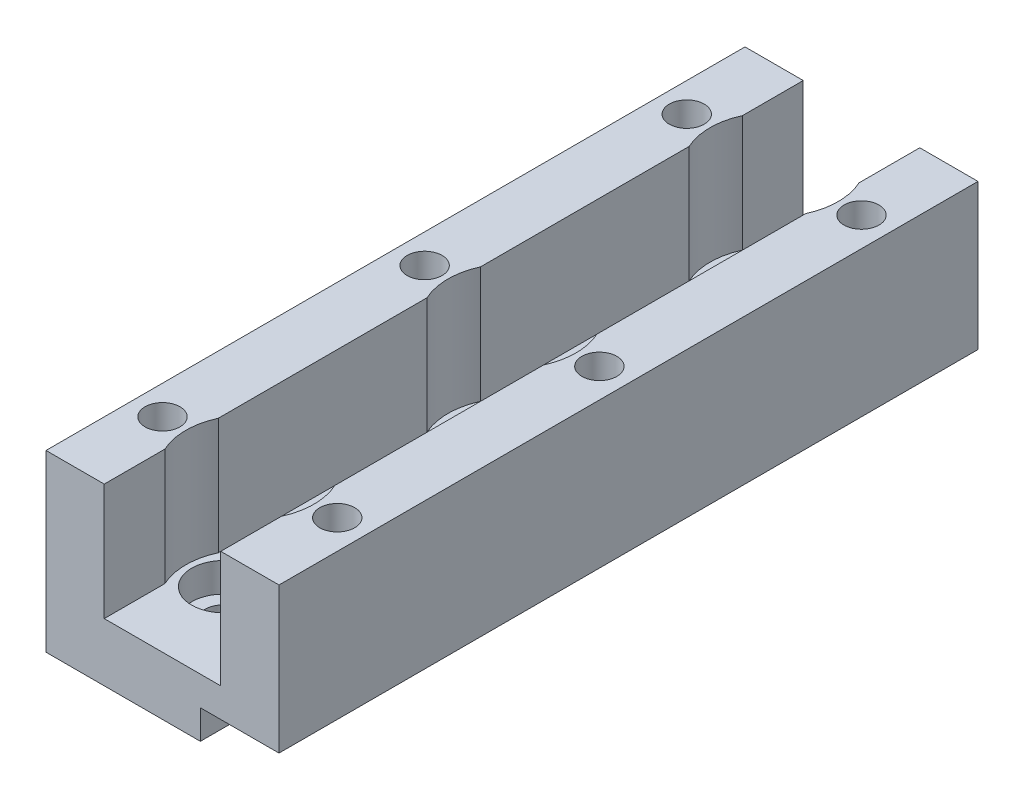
ISO-10303-21;
HEADER;
FILE_DESCRIPTION(('STEP AP214'),'2;1');
FILE_NAME('part.step','',(''),(''),'','','');
FILE_SCHEMA(('AUTOMOTIVE_DESIGN { 1 0 10303 214 1 1 1 1 }'));
ENDSEC;
DATA;
#1=APPLICATION_CONTEXT('core data for automotive mechanical design processes');
#2=APPLICATION_PROTOCOL_DEFINITION('international standard','automotive_design',2000,#1);
#3=PRODUCT_CONTEXT('',#1,'mechanical');
#4=PRODUCT('Part','Part','',(#3));
#5=PRODUCT_RELATED_PRODUCT_CATEGORY('part','',(#4));
#6=PRODUCT_DEFINITION_FORMATION('','',#4);
#7=PRODUCT_DEFINITION_CONTEXT('part definition',#1,'design');
#8=PRODUCT_DEFINITION('design','',#6,#7);
#9=PRODUCT_DEFINITION_SHAPE('','',#8);
#10=(LENGTH_UNIT() NAMED_UNIT(*) SI_UNIT(.MILLI.,.METRE.));
#11=(NAMED_UNIT(*) PLANE_ANGLE_UNIT() SI_UNIT($,.RADIAN.));
#12=(NAMED_UNIT(*) SI_UNIT($,.STERADIAN.) SOLID_ANGLE_UNIT());
#13=UNCERTAINTY_MEASURE_WITH_UNIT(LENGTH_MEASURE(1.E-05),#10,'distance_accuracy_value','');
#14=(GEOMETRIC_REPRESENTATION_CONTEXT(3) GLOBAL_UNCERTAINTY_ASSIGNED_CONTEXT((#13)) GLOBAL_UNIT_ASSIGNED_CONTEXT((#10,
#11,#12)) REPRESENTATION_CONTEXT('',''));
#15=CARTESIAN_POINT('',(0.,0.,0.));
#16=DIRECTION('',(0.,0.,1.));
#17=DIRECTION('',(1.,0.,0.));
#18=AXIS2_PLACEMENT_3D('',#15,#16,#17);
#19=CARTESIAN_POINT('',(3.5,9.99999999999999,120.));
#20=DIRECTION('',(1.,0.,0.));
#21=DIRECTION('',(0.,0.,-1.));
#22=AXIS2_PLACEMENT_3D('',#19,#20,#21);
#23=PLANE('',#22);
#24=DIRECTION('',(0.,0.,-1.));
#25=VECTOR('',#24,1.);
#26=CARTESIAN_POINT('',(3.5,9.99999999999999,120.));
#27=LINE('',#26,#25);
#28=CARTESIAN_POINT('',(3.5,9.99999999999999,10.4174243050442));
#29=VERTEX_POINT('',#28);
#30=CARTESIAN_POINT('',(3.5,9.99999999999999,0.));
#31=VERTEX_POINT('',#30);
#32=EDGE_CURVE('E207',#29,#31,#27,.T.);
#33=ORIENTED_EDGE('',*,*,#32,.F.);
#34=DIRECTION('',(0.,1.,0.));
#35=VECTOR('',#34,1.);
#36=CARTESIAN_POINT('',(3.5,-21.1126983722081,10.4174243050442));
#37=LINE('',#36,#35);
#38=CARTESIAN_POINT('',(3.5,30.,10.4174243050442));
#39=VERTEX_POINT('',#38);
#40=EDGE_CURVE('E632',#29,#39,#37,.T.);
#41=ORIENTED_EDGE('',*,*,#40,.T.);
#42=DIRECTION('',(0.,0.,-1.));
#43=VECTOR('',#42,1.);
#44=CARTESIAN_POINT('',(3.5,30.,120.));
#45=LINE('',#44,#43);
#46=CARTESIAN_POINT('',(3.5,30.,0.));
#47=VERTEX_POINT('',#46);
#48=EDGE_CURVE('E465',#39,#47,#45,.T.);
#49=ORIENTED_EDGE('',*,*,#48,.T.);
#50=DIRECTION('',(0.,-1.,0.));
#51=VECTOR('',#50,1.);
#52=CARTESIAN_POINT('',(3.5,9.99999999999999,0.));
#53=LINE('',#52,#51);
#54=EDGE_CURVE('E335',#47,#31,#53,.T.);
#55=ORIENTED_EDGE('',*,*,#54,.T.);
#56=EDGE_LOOP('',(#33,#41,#49,#55));
#57=FACE_BOUND('',#56,.T.);
#58=ADVANCED_FACE('F28',(#57),#23,.F.);
#59=CARTESIAN_POINT('',(-16.5,30.,120.));
#60=DIRECTION('',(-1.,0.,0.));
#61=DIRECTION('',(0.,-1.,0.));
#62=AXIS2_PLACEMENT_3D('',#59,#60,#61);
#63=PLANE('',#62);
#64=DIRECTION('',(0.,0.,-1.));
#65=VECTOR('',#64,1.);
#66=CARTESIAN_POINT('',(-16.5,9.99999999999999,120.));
#67=LINE('',#66,#65);
#68=CARTESIAN_POINT('',(-16.5,9.99999999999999,55.4174243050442));
#69=VERTEX_POINT('',#68);
#70=CARTESIAN_POINT('',(-16.5,9.99999999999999,19.5825756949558));
#71=VERTEX_POINT('',#70);
#72=EDGE_CURVE('E197',#69,#71,#67,.T.);
#73=ORIENTED_EDGE('',*,*,#72,.T.);
#74=DIRECTION('',(0.,1.,0.));
#75=VECTOR('',#74,1.);
#76=CARTESIAN_POINT('',(-16.5,-21.1126983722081,19.5825756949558));
#77=LINE('',#76,#75);
#78=CARTESIAN_POINT('',(-16.5,30.,19.5825756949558));
#79=VERTEX_POINT('',#78);
#80=EDGE_CURVE('E177',#71,#79,#77,.T.);
#81=ORIENTED_EDGE('',*,*,#80,.T.);
#82=DIRECTION('',(0.,0.,-1.));
#83=VECTOR('',#82,1.);
#84=CARTESIAN_POINT('',(-16.5,30.,120.));
#85=LINE('',#84,#83);
#86=CARTESIAN_POINT('',(-16.5,30.,55.4174243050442));
#87=VERTEX_POINT('',#86);
#88=EDGE_CURVE('E380',#87,#79,#85,.T.);
#89=ORIENTED_EDGE('',*,*,#88,.F.);
#90=DIRECTION('',(0.,1.,0.));
#91=VECTOR('',#90,1.);
#92=CARTESIAN_POINT('',(-16.5,-21.1126983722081,55.4174243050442));
#93=LINE('',#92,#91);
#94=EDGE_CURVE('E230',#87,#69,#93,.F.);
#95=ORIENTED_EDGE('',*,*,#94,.T.);
#96=EDGE_LOOP('',(#73,#81,#89,#95));
#97=FACE_BOUND('',#96,.T.);
#98=ADVANCED_FACE('F420',(#97),#63,.F.);
#99=CARTESIAN_POINT('',(3.5,30.,55.4174243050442));
#100=VERTEX_POINT('',#99);
#101=CARTESIAN_POINT('',(3.5,30.,19.5825756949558));
#102=VERTEX_POINT('',#101);
#103=EDGE_CURVE('E462',#100,#102,#45,.T.);
#104=ORIENTED_EDGE('',*,*,#103,.T.);
#105=DIRECTION('',(0.,1.,0.));
#106=VECTOR('',#105,1.);
#107=CARTESIAN_POINT('',(3.5,-21.1126983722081,19.5825756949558));
#108=LINE('',#107,#106);
#109=CARTESIAN_POINT('',(3.5,9.99999999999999,19.5825756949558));
#110=VERTEX_POINT('',#109);
#111=EDGE_CURVE('E43',#102,#110,#108,.F.);
#112=ORIENTED_EDGE('',*,*,#111,.T.);
#113=CARTESIAN_POINT('',(3.5,9.99999999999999,55.4174243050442));
#114=VERTEX_POINT('',#113);
#115=EDGE_CURVE('E212',#114,#110,#27,.T.);
#116=ORIENTED_EDGE('',*,*,#115,.F.);
#117=DIRECTION('',(0.,1.,0.));
#118=VECTOR('',#117,1.);
#119=CARTESIAN_POINT('',(3.5,-21.1126983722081,55.4174243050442));
#120=LINE('',#119,#118);
#121=EDGE_CURVE('E243',#114,#100,#120,.T.);
#122=ORIENTED_EDGE('',*,*,#121,.T.);
#123=EDGE_LOOP('',(#104,#112,#116,#122));
#124=FACE_BOUND('',#123,.T.);
#125=ADVANCED_FACE('F417',(#124),#23,.F.);
#126=CARTESIAN_POINT('',(-16.5,9.99999999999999,100.417424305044));
#127=VERTEX_POINT('',#126);
#128=CARTESIAN_POINT('',(-16.5,9.99999999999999,64.5825756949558));
#129=VERTEX_POINT('',#128);
#130=EDGE_CURVE('E201',#127,#129,#67,.T.);
#131=ORIENTED_EDGE('',*,*,#130,.T.);
#132=DIRECTION('',(0.,1.,0.));
#133=VECTOR('',#132,1.);
#134=CARTESIAN_POINT('',(-16.5,-21.1126983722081,64.5825756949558));
#135=LINE('',#134,#133);
#136=CARTESIAN_POINT('',(-16.5,30.,64.5825756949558));
#137=VERTEX_POINT('',#136);
#138=EDGE_CURVE('E221',#129,#137,#135,.T.);
#139=ORIENTED_EDGE('',*,*,#138,.T.);
#140=CARTESIAN_POINT('',(-16.5,30.,100.417424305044));
#141=VERTEX_POINT('',#140);
#142=EDGE_CURVE('E203',#141,#137,#85,.T.);
#143=ORIENTED_EDGE('',*,*,#142,.F.);
#144=DIRECTION('',(0.,1.,0.));
#145=VECTOR('',#144,1.);
#146=CARTESIAN_POINT('',(-16.5,-21.1126983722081,100.417424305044));
#147=LINE('',#146,#145);
#148=EDGE_CURVE('E223',#141,#127,#147,.F.);
#149=ORIENTED_EDGE('',*,*,#148,.T.);
#150=EDGE_LOOP('',(#131,#139,#143,#149));
#151=FACE_BOUND('',#150,.T.);
#152=ADVANCED_FACE('F219',(#151),#63,.F.);
#153=CARTESIAN_POINT('',(-11.,-0.00100000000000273,15.));
#154=DIRECTION('',(0.,1.,0.));
#155=DIRECTION('',(0.,0.,1.));
#156=AXIS2_PLACEMENT_3D('',#153,#154,#155);
#157=CYLINDRICAL_SURFACE('',#156,3.25);
#158=CARTESIAN_POINT('',(-11.,0.,15.));
#159=DIRECTION('',(0.,1.,0.));
#160=DIRECTION('',(-1.,0.,0.));
#161=AXIS2_PLACEMENT_3D('',#158,#159,#160);
#162=CIRCLE('',#161,3.25);
#163=CARTESIAN_POINT('',(-14.25,0.,15.));
#164=VERTEX_POINT('',#163);
#165=EDGE_CURVE('E260',#164,#164,#162,.F.);
#166=ORIENTED_EDGE('',*,*,#165,.T.);
#167=EDGE_LOOP('',(#166));
#168=FACE_BOUND('',#167,.T.);
#169=CARTESIAN_POINT('',(-11.,4.99999999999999,15.));
#170=DIRECTION('',(0.,1.,0.));
#171=DIRECTION('',(0.,0.,1.));
#172=AXIS2_PLACEMENT_3D('',#169,#170,#171);
#173=CIRCLE('',#172,3.25);
#174=CARTESIAN_POINT('',(-11.,4.99999999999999,18.25));
#175=VERTEX_POINT('',#174);
#176=EDGE_CURVE('E252',#175,#175,#173,.F.);
#177=ORIENTED_EDGE('',*,*,#176,.F.);
#178=EDGE_LOOP('',(#177));
#179=FACE_BOUND('',#178,.T.);
#180=ADVANCED_FACE('F405',(#168,#179),#157,.F.);
#181=CARTESIAN_POINT('',(-11.,-0.00100000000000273,60.));
#182=DIRECTION('',(0.,1.,0.));
#183=DIRECTION('',(0.,0.,1.));
#184=AXIS2_PLACEMENT_3D('',#181,#182,#183);
#185=CYLINDRICAL_SURFACE('',#184,3.25);
#186=CARTESIAN_POINT('',(-11.,0.,60.));
#187=DIRECTION('',(0.,1.,0.));
#188=DIRECTION('',(-1.,0.,0.));
#189=AXIS2_PLACEMENT_3D('',#186,#187,#188);
#190=CIRCLE('',#189,3.25);
#191=CARTESIAN_POINT('',(-14.25,0.,60.));
#192=VERTEX_POINT('',#191);
#193=EDGE_CURVE('E263',#192,#192,#190,.F.);
#194=ORIENTED_EDGE('',*,*,#193,.T.);
#195=EDGE_LOOP('',(#194));
#196=FACE_BOUND('',#195,.T.);
#197=CARTESIAN_POINT('',(-11.,4.99999999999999,60.));
#198=DIRECTION('',(0.,1.,0.));
#199=DIRECTION('',(0.,0.,1.));
#200=AXIS2_PLACEMENT_3D('',#197,#198,#199);
#201=CIRCLE('',#200,3.25);
#202=CARTESIAN_POINT('',(-11.,4.99999999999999,63.25));
#203=VERTEX_POINT('',#202);
#204=EDGE_CURVE('E259',#203,#203,#201,.F.);
#205=ORIENTED_EDGE('',*,*,#204,.F.);
#206=EDGE_LOOP('',(#205));
#207=FACE_BOUND('',#206,.T.);
#208=ADVANCED_FACE('F407',(#196,#207),#185,.F.);
#209=CARTESIAN_POINT('',(3.5,30.,100.417424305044));
#210=VERTEX_POINT('',#209);
#211=CARTESIAN_POINT('',(3.5,30.,64.5825756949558));
#212=VERTEX_POINT('',#211);
#213=EDGE_CURVE('E455',#210,#212,#45,.T.);
#214=ORIENTED_EDGE('',*,*,#213,.T.);
#215=DIRECTION('',(0.,1.,0.));
#216=VECTOR('',#215,1.);
#217=CARTESIAN_POINT('',(3.5,-21.1126983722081,64.5825756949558));
#218=LINE('',#217,#216);
#219=CARTESIAN_POINT('',(3.5,9.99999999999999,64.5825756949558));
#220=VERTEX_POINT('',#219);
#221=EDGE_CURVE('E240',#212,#220,#218,.F.);
#222=ORIENTED_EDGE('',*,*,#221,.T.);
#223=CARTESIAN_POINT('',(3.5,9.99999999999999,100.417424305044));
#224=VERTEX_POINT('',#223);
#225=EDGE_CURVE('E638',#224,#220,#27,.T.);
#226=ORIENTED_EDGE('',*,*,#225,.F.);
#227=DIRECTION('',(0.,1.,0.));
#228=VECTOR('',#227,1.);
#229=CARTESIAN_POINT('',(3.5,-21.1126983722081,100.417424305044));
#230=LINE('',#229,#228);
#231=EDGE_CURVE('E276',#224,#210,#230,.T.);
#232=ORIENTED_EDGE('',*,*,#231,.T.);
#233=EDGE_LOOP('',(#214,#222,#226,#232));
#234=FACE_BOUND('',#233,.T.);
#235=ADVANCED_FACE('F414',(#234),#23,.F.);
#236=CARTESIAN_POINT('',(-16.5,9.99999999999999,120.));
#237=VERTEX_POINT('',#236);
#238=CARTESIAN_POINT('',(-16.5,9.99999999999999,109.582575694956));
#239=VERTEX_POINT('',#238);
#240=EDGE_CURVE('E200',#237,#239,#67,.T.);
#241=ORIENTED_EDGE('',*,*,#240,.T.);
#242=DIRECTION('',(0.,1.,0.));
#243=VECTOR('',#242,1.);
#244=CARTESIAN_POINT('',(-16.5,-21.1126983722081,109.582575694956));
#245=LINE('',#244,#243);
#246=CARTESIAN_POINT('',(-16.5,30.,109.582575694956));
#247=VERTEX_POINT('',#246);
#248=EDGE_CURVE('E271',#239,#247,#245,.T.);
#249=ORIENTED_EDGE('',*,*,#248,.T.);
#250=CARTESIAN_POINT('',(-16.5,30.,120.));
#251=VERTEX_POINT('',#250);
#252=EDGE_CURVE('E198',#251,#247,#85,.T.);
#253=ORIENTED_EDGE('',*,*,#252,.F.);
#254=DIRECTION('',(0.,1.,0.));
#255=VECTOR('',#254,1.);
#256=CARTESIAN_POINT('',(-16.5,30.,120.));
#257=LINE('',#256,#255);
#258=EDGE_CURVE('E360',#237,#251,#257,.T.);
#259=ORIENTED_EDGE('',*,*,#258,.F.);
#260=EDGE_LOOP('',(#241,#249,#253,#259));
#261=FACE_BOUND('',#260,.T.);
#262=ADVANCED_FACE('F419',(#261),#63,.F.);
#263=CARTESIAN_POINT('',(-11.,-0.00100000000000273,105.));
#264=DIRECTION('',(0.,1.,0.));
#265=DIRECTION('',(0.,0.,1.));
#266=AXIS2_PLACEMENT_3D('',#263,#264,#265);
#267=CYLINDRICAL_SURFACE('',#266,3.25);
#268=CARTESIAN_POINT('',(-11.,0.,105.));
#269=DIRECTION('',(0.,1.,0.));
#270=DIRECTION('',(-1.,0.,0.));
#271=AXIS2_PLACEMENT_3D('',#268,#269,#270);
#272=CIRCLE('',#271,3.25);
#273=CARTESIAN_POINT('',(-14.25,0.,105.));
#274=VERTEX_POINT('',#273);
#275=EDGE_CURVE('E286',#274,#274,#272,.F.);
#276=ORIENTED_EDGE('',*,*,#275,.T.);
#277=EDGE_LOOP('',(#276));
#278=FACE_BOUND('',#277,.T.);
#279=CARTESIAN_POINT('',(-11.,4.99999999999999,105.));
#280=DIRECTION('',(0.,1.,0.));
#281=DIRECTION('',(0.,0.,1.));
#282=AXIS2_PLACEMENT_3D('',#279,#280,#281);
#283=CIRCLE('',#282,3.25);
#284=CARTESIAN_POINT('',(-11.,4.99999999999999,108.25));
#285=VERTEX_POINT('',#284);
#286=EDGE_CURVE('E285',#285,#285,#283,.F.);
#287=ORIENTED_EDGE('',*,*,#286,.F.);
#288=EDGE_LOOP('',(#287));
#289=FACE_BOUND('',#288,.T.);
#290=ADVANCED_FACE('F452',(#278,#289),#267,.F.);
#291=CARTESIAN_POINT('',(0.,5.,120.));
#292=DIRECTION('',(-1.,0.,0.));
#293=DIRECTION('',(0.,-1.,0.));
#294=AXIS2_PLACEMENT_3D('',#291,#292,#293);
#295=PLANE('',#294);
#296=DIRECTION('',(0.,1.,0.));
#297=VECTOR('',#296,1.);
#298=CARTESIAN_POINT('',(0.,5.,0.));
#299=LINE('',#298,#297);
#300=CARTESIAN_POINT('',(0.,0.,0.));
#301=VERTEX_POINT('',#300);
#302=CARTESIAN_POINT('',(0.,5.,0.));
#303=VERTEX_POINT('',#302);
#304=EDGE_CURVE('E325',#301,#303,#299,.T.);
#305=ORIENTED_EDGE('',*,*,#304,.T.);
#306=DIRECTION('',(0.,0.,-1.));
#307=VECTOR('',#306,1.);
#308=CARTESIAN_POINT('',(0.,5.,120.));
#309=LINE('',#308,#307);
#310=CARTESIAN_POINT('',(0.,5.,120.));
#311=VERTEX_POINT('',#310);
#312=EDGE_CURVE('E391',#311,#303,#309,.T.);
#313=ORIENTED_EDGE('',*,*,#312,.F.);
#314=DIRECTION('',(0.,1.,0.));
#315=VECTOR('',#314,1.);
#316=CARTESIAN_POINT('',(0.,5.,120.));
#317=LINE('',#316,#315);
#318=CARTESIAN_POINT('',(0.,0.,120.));
#319=VERTEX_POINT('',#318);
#320=EDGE_CURVE('E347',#319,#311,#317,.T.);
#321=ORIENTED_EDGE('',*,*,#320,.F.);
#322=DIRECTION('',(0.,0.,-1.));
#323=VECTOR('',#322,1.);
#324=CARTESIAN_POINT('',(0.,0.,120.));
#325=LINE('',#324,#323);
#326=EDGE_CURVE('E368',#319,#301,#325,.T.);
#327=ORIENTED_EDGE('',*,*,#326,.T.);
#328=EDGE_LOOP('',(#305,#313,#321,#327));
#329=FACE_BOUND('',#328,.T.);
#330=ADVANCED_FACE('F30',(#329),#295,.F.);
#331=CARTESIAN_POINT('',(13.5,5.,120.));
#332=DIRECTION('',(0.,1.,0.));
#333=DIRECTION('',(0.,0.,1.));
#334=AXIS2_PLACEMENT_3D('',#331,#332,#333);
#335=PLANE('',#334);
#336=CARTESIAN_POINT('',(8.49999999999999,5.,105.));
#337=DIRECTION('',(0.,1.,0.));
#338=DIRECTION('',(0.,0.,1.));
#339=AXIS2_PLACEMENT_3D('',#336,#337,#338);
#340=CIRCLE('',#339,3.);
#341=CARTESIAN_POINT('',(5.49999999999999,5.,105.));
#342=VERTEX_POINT('',#341);
#343=EDGE_CURVE('E298',#342,#342,#340,.F.);
#344=ORIENTED_EDGE('',*,*,#343,.F.);
#345=EDGE_LOOP('',(#344));
#346=FACE_BOUND('',#345,.T.);
#347=CARTESIAN_POINT('',(8.49999999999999,5.,60.));
#348=DIRECTION('',(0.,1.,0.));
#349=DIRECTION('',(0.,0.,1.));
#350=AXIS2_PLACEMENT_3D('',#347,#348,#349);
#351=CIRCLE('',#350,3.);
#352=CARTESIAN_POINT('',(5.49999999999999,5.,60.));
#353=VERTEX_POINT('',#352);
#354=EDGE_CURVE('E310',#353,#353,#351,.F.);
#355=ORIENTED_EDGE('',*,*,#354,.F.);
#356=EDGE_LOOP('',(#355));
#357=FACE_BOUND('',#356,.T.);
#358=CARTESIAN_POINT('',(8.49999999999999,5.,15.));
#359=DIRECTION('',(0.,1.,0.));
#360=DIRECTION('',(0.,0.,1.));
#361=AXIS2_PLACEMENT_3D('',#358,#359,#360);
#362=CIRCLE('',#361,3.);
#363=CARTESIAN_POINT('',(5.49999999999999,5.,15.));
#364=VERTEX_POINT('',#363);
#365=EDGE_CURVE('E322',#364,#364,#362,.F.);
#366=ORIENTED_EDGE('',*,*,#365,.F.);
#367=EDGE_LOOP('',(#366));
#368=FACE_BOUND('',#367,.T.);
#369=DIRECTION('',(1.,0.,0.));
#370=VECTOR('',#369,1.);
#371=CARTESIAN_POINT('',(13.5,5.,0.));
#372=LINE('',#371,#370);
#373=CARTESIAN_POINT('',(13.5,5.,0.));
#374=VERTEX_POINT('',#373);
#375=EDGE_CURVE('E328',#303,#374,#372,.T.);
#376=ORIENTED_EDGE('',*,*,#375,.T.);
#377=DIRECTION('',(0.,0.,-1.));
#378=VECTOR('',#377,1.);
#379=CARTESIAN_POINT('',(13.5,5.,120.));
#380=LINE('',#379,#378);
#381=CARTESIAN_POINT('',(13.5,5.,120.));
#382=VERTEX_POINT('',#381);
#383=EDGE_CURVE('E394',#382,#374,#380,.T.);
#384=ORIENTED_EDGE('',*,*,#383,.F.);
#385=DIRECTION('',(1.,0.,0.));
#386=VECTOR('',#385,1.);
#387=CARTESIAN_POINT('',(13.5,5.,120.));
#388=LINE('',#387,#386);
#389=EDGE_CURVE('E350',#311,#382,#388,.T.);
#390=ORIENTED_EDGE('',*,*,#389,.F.);
#391=ORIENTED_EDGE('',*,*,#312,.T.);
#392=EDGE_LOOP('',(#376,#384,#390,#391));
#393=FACE_BOUND('',#392,.T.);
#394=ADVANCED_FACE('F491',(#346,#357,#368,#393),#335,.F.);
#395=CARTESIAN_POINT('',(13.5,30.,120.));
#396=DIRECTION('',(-1.,0.,0.));
#397=DIRECTION('',(0.,-1.,0.));
#398=AXIS2_PLACEMENT_3D('',#395,#396,#397);
#399=PLANE('',#398);
#400=DIRECTION('',(0.,1.,0.));
#401=VECTOR('',#400,1.);
#402=CARTESIAN_POINT('',(13.5,30.,0.));
#403=LINE('',#402,#401);
#404=CARTESIAN_POINT('',(13.5,30.,0.));
#405=VERTEX_POINT('',#404);
#406=EDGE_CURVE('E330',#374,#405,#403,.T.);
#407=ORIENTED_EDGE('',*,*,#406,.T.);
#408=DIRECTION('',(0.,0.,-1.));
#409=VECTOR('',#408,1.);
#410=CARTESIAN_POINT('',(13.5,30.,120.));
#411=LINE('',#410,#409);
#412=CARTESIAN_POINT('',(13.5,30.,120.));
#413=VERTEX_POINT('',#412);
#414=EDGE_CURVE('E464',#413,#405,#411,.T.);
#415=ORIENTED_EDGE('',*,*,#414,.F.);
#416=DIRECTION('',(0.,1.,0.));
#417=VECTOR('',#416,1.);
#418=CARTESIAN_POINT('',(13.5,30.,120.));
#419=LINE('',#418,#417);
#420=EDGE_CURVE('E352',#382,#413,#419,.T.);
#421=ORIENTED_EDGE('',*,*,#420,.F.);
#422=ORIENTED_EDGE('',*,*,#383,.T.);
#423=EDGE_LOOP('',(#407,#415,#421,#422));
#424=FACE_BOUND('',#423,.T.);
#425=ADVANCED_FACE('F445',(#424),#399,.F.);
#426=CARTESIAN_POINT('',(3.5,30.,120.));
#427=DIRECTION('',(0.,-1.,0.));
#428=DIRECTION('',(1.,0.,0.));
#429=AXIS2_PLACEMENT_3D('',#426,#427,#428);
#430=PLANE('',#429);
#431=CARTESIAN_POINT('',(8.5,30.,105.));
#432=DIRECTION('',(0.,1.,0.));
#433=DIRECTION('',(-1.,0.,0.));
#434=AXIS2_PLACEMENT_3D('',#431,#432,#433);
#435=CIRCLE('',#434,3.);
#436=CARTESIAN_POINT('',(5.5,30.,105.));
#437=VERTEX_POINT('',#436);
#438=EDGE_CURVE('E295',#437,#437,#435,.T.);
#439=ORIENTED_EDGE('',*,*,#438,.F.);
#440=EDGE_LOOP('',(#439));
#441=FACE_BOUND('',#440,.T.);
#442=CARTESIAN_POINT('',(8.5,30.,60.));
#443=DIRECTION('',(0.,1.,0.));
#444=DIRECTION('',(-1.,0.,0.));
#445=AXIS2_PLACEMENT_3D('',#442,#443,#444);
#446=CIRCLE('',#445,3.);
#447=CARTESIAN_POINT('',(5.5,30.,60.));
#448=VERTEX_POINT('',#447);
#449=EDGE_CURVE('E307',#448,#448,#446,.T.);
#450=ORIENTED_EDGE('',*,*,#449,.F.);
#451=EDGE_LOOP('',(#450));
#452=FACE_BOUND('',#451,.T.);
#453=CARTESIAN_POINT('',(8.5,30.,15.));
#454=DIRECTION('',(0.,1.,0.));
#455=DIRECTION('',(-1.,0.,0.));
#456=AXIS2_PLACEMENT_3D('',#453,#454,#455);
#457=CIRCLE('',#456,3.);
#458=CARTESIAN_POINT('',(5.5,30.,15.));
#459=VERTEX_POINT('',#458);
#460=EDGE_CURVE('E319',#459,#459,#457,.T.);
#461=ORIENTED_EDGE('',*,*,#460,.F.);
#462=EDGE_LOOP('',(#461));
#463=FACE_BOUND('',#462,.T.);
#464=ORIENTED_EDGE('',*,*,#48,.F.);
#465=CARTESIAN_POINT('',(-6.5,30.,15.));
#466=DIRECTION('',(0.,1.,0.));
#467=DIRECTION('',(0.,0.,1.));
#468=AXIS2_PLACEMENT_3D('',#465,#466,#467);
#469=CIRCLE('',#468,11.);
#470=EDGE_CURVE('E634',#102,#39,#469,.T.);
#471=ORIENTED_EDGE('',*,*,#470,.F.);
#472=ORIENTED_EDGE('',*,*,#103,.F.);
#473=CARTESIAN_POINT('',(-6.5,30.,60.));
#474=DIRECTION('',(0.,1.,0.));
#475=DIRECTION('',(0.,0.,1.));
#476=AXIS2_PLACEMENT_3D('',#473,#474,#475);
#477=CIRCLE('',#476,11.);
#478=EDGE_CURVE('E235',#212,#100,#477,.T.);
#479=ORIENTED_EDGE('',*,*,#478,.F.);
#480=ORIENTED_EDGE('',*,*,#213,.F.);
#481=CARTESIAN_POINT('',(-6.5,30.,105.));
#482=DIRECTION('',(0.,1.,0.));
#483=DIRECTION('',(0.,0.,1.));
#484=AXIS2_PLACEMENT_3D('',#481,#482,#483);
#485=CIRCLE('',#484,11.);
#486=CARTESIAN_POINT('',(3.5,30.,109.582575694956));
#487=VERTEX_POINT('',#486);
#488=EDGE_CURVE('E266',#487,#210,#485,.T.);
#489=ORIENTED_EDGE('',*,*,#488,.F.);
#490=CARTESIAN_POINT('',(3.5,30.,120.));
#491=VERTEX_POINT('',#490);
#492=EDGE_CURVE('E461',#491,#487,#45,.T.);
#493=ORIENTED_EDGE('',*,*,#492,.F.);
#494=DIRECTION('',(-1.,0.,0.));
#495=VECTOR('',#494,1.);
#496=CARTESIAN_POINT('',(3.5,30.,120.));
#497=LINE('',#496,#495);
#498=EDGE_CURVE('E354',#413,#491,#497,.T.);
#499=ORIENTED_EDGE('',*,*,#498,.F.);
#500=ORIENTED_EDGE('',*,*,#414,.T.);
#501=DIRECTION('',(-1.,0.,0.));
#502=VECTOR('',#501,1.);
#503=CARTESIAN_POINT('',(3.5,30.,0.));
#504=LINE('',#503,#502);
#505=EDGE_CURVE('E332',#405,#47,#504,.T.);
#506=ORIENTED_EDGE('',*,*,#505,.T.);
#507=EDGE_LOOP('',(#464,#471,#472,#479,#480,#489,#493,#499,#500,#506));
#508=FACE_BOUND('',#507,.T.);
#509=ADVANCED_FACE('F437',(#441,#452,#463,#508),#430,.F.);
#510=ORIENTED_EDGE('',*,*,#492,.T.);
#511=DIRECTION('',(0.,1.,0.));
#512=VECTOR('',#511,1.);
#513=CARTESIAN_POINT('',(3.5,-21.1126983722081,109.582575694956));
#514=LINE('',#513,#512);
#515=CARTESIAN_POINT('',(3.5,9.99999999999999,109.582575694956));
#516=VERTEX_POINT('',#515);
#517=EDGE_CURVE('E273',#487,#516,#514,.F.);
#518=ORIENTED_EDGE('',*,*,#517,.T.);
#519=CARTESIAN_POINT('',(3.5,9.99999999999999,120.));
#520=VERTEX_POINT('',#519);
#521=EDGE_CURVE('E213',#520,#516,#27,.T.);
#522=ORIENTED_EDGE('',*,*,#521,.F.);
#523=DIRECTION('',(0.,-1.,0.));
#524=VECTOR('',#523,1.);
#525=CARTESIAN_POINT('',(3.5,9.99999999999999,120.));
#526=LINE('',#525,#524);
#527=EDGE_CURVE('E356',#491,#520,#526,.T.);
#528=ORIENTED_EDGE('',*,*,#527,.F.);
#529=EDGE_LOOP('',(#510,#518,#522,#528));
#530=FACE_BOUND('',#529,.T.);
#531=ADVANCED_FACE('F425',(#530),#23,.F.);
#532=CARTESIAN_POINT('',(-16.5,9.99999999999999,120.));
#533=DIRECTION('',(0.,-1.,0.));
#534=DIRECTION('',(0.,0.,-1.));
#535=AXIS2_PLACEMENT_3D('',#532,#533,#534);
#536=PLANE('',#535);
#537=CARTESIAN_POINT('',(-16.5,9.99999999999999,10.4174243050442));
#538=VERTEX_POINT('',#537);
#539=CARTESIAN_POINT('',(-16.5,9.99999999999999,0.));
#540=VERTEX_POINT('',#539);
#541=EDGE_CURVE('E188',#538,#540,#67,.T.);
#542=ORIENTED_EDGE('',*,*,#541,.F.);
#543=CARTESIAN_POINT('',(-6.5,9.99999999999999,15.));
#544=DIRECTION('',(0.,-1.,0.));
#545=DIRECTION('',(0.,0.,-1.));
#546=AXIS2_PLACEMENT_3D('',#543,#544,#545);
#547=CIRCLE('',#546,11.);
#548=EDGE_CURVE('E174',#538,#71,#547,.F.);
#549=ORIENTED_EDGE('',*,*,#548,.T.);
#550=ORIENTED_EDGE('',*,*,#72,.F.);
#551=CARTESIAN_POINT('',(-6.5,9.99999999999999,60.));
#552=DIRECTION('',(0.,-1.,0.));
#553=DIRECTION('',(0.,0.,-1.));
#554=AXIS2_PLACEMENT_3D('',#551,#552,#553);
#555=CIRCLE('',#554,11.);
#556=EDGE_CURVE('E227',#69,#129,#555,.F.);
#557=ORIENTED_EDGE('',*,*,#556,.T.);
#558=ORIENTED_EDGE('',*,*,#130,.F.);
#559=CARTESIAN_POINT('',(-6.5,9.99999999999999,105.));
#560=DIRECTION('',(0.,-1.,0.));
#561=DIRECTION('',(0.,0.,-1.));
#562=AXIS2_PLACEMENT_3D('',#559,#560,#561);
#563=CIRCLE('',#562,11.);
#564=EDGE_CURVE('E226',#127,#239,#563,.F.);
#565=ORIENTED_EDGE('',*,*,#564,.T.);
#566=ORIENTED_EDGE('',*,*,#240,.F.);
#567=DIRECTION('',(-1.,0.,0.));
#568=VECTOR('',#567,1.);
#569=CARTESIAN_POINT('',(-16.5,9.99999999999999,120.));
#570=LINE('',#569,#568);
#571=EDGE_CURVE('E358',#520,#237,#570,.T.);
#572=ORIENTED_EDGE('',*,*,#571,.F.);
#573=ORIENTED_EDGE('',*,*,#521,.T.);
#574=EDGE_CURVE('E268',#516,#224,#563,.F.);
#575=ORIENTED_EDGE('',*,*,#574,.T.);
#576=ORIENTED_EDGE('',*,*,#225,.T.);
#577=EDGE_CURVE('E231',#220,#114,#555,.F.);
#578=ORIENTED_EDGE('',*,*,#577,.T.);
#579=ORIENTED_EDGE('',*,*,#115,.T.);
#580=EDGE_CURVE('E182',#110,#29,#547,.F.);
#581=ORIENTED_EDGE('',*,*,#580,.T.);
#582=ORIENTED_EDGE('',*,*,#32,.T.);
#583=DIRECTION('',(-1.,0.,0.));
#584=VECTOR('',#583,1.);
#585=CARTESIAN_POINT('',(-16.5,9.99999999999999,0.));
#586=LINE('',#585,#584);
#587=EDGE_CURVE('E195',#31,#540,#586,.T.);
#588=ORIENTED_EDGE('',*,*,#587,.T.);
#589=EDGE_LOOP('',(#542,#549,#550,#557,#558,#565,#566,#572,#573,#575,#576,#578,#579,#581,#582,#588));
#590=FACE_BOUND('',#589,.T.);
#591=CARTESIAN_POINT('',(-11.,9.99999999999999,15.));
#592=DIRECTION('',(0.,1.,0.));
#593=DIRECTION('',(0.,0.,1.));
#594=AXIS2_PLACEMENT_3D('',#591,#592,#593);
#595=CIRCLE('',#594,5.5);
#596=CARTESIAN_POINT('',(-11.,9.99999999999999,20.5));
#597=VERTEX_POINT('',#596);
#598=EDGE_CURVE('E246',#597,#597,#595,.T.);
#599=ORIENTED_EDGE('',*,*,#598,.F.);
#600=EDGE_LOOP('',(#599));
#601=FACE_BOUND('',#600,.T.);
#602=CARTESIAN_POINT('',(-11.,9.99999999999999,105.));
#603=DIRECTION('',(0.,1.,0.));
#604=DIRECTION('',(0.,0.,1.));
#605=AXIS2_PLACEMENT_3D('',#602,#603,#604);
#606=CIRCLE('',#605,5.5);
#607=CARTESIAN_POINT('',(-11.,9.99999999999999,110.5));
#608=VERTEX_POINT('',#607);
#609=EDGE_CURVE('E279',#608,#608,#606,.T.);
#610=ORIENTED_EDGE('',*,*,#609,.F.);
#611=EDGE_LOOP('',(#610));
#612=FACE_BOUND('',#611,.T.);
#613=CARTESIAN_POINT('',(-11.,9.99999999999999,60.));
#614=DIRECTION('',(0.,1.,0.));
#615=DIRECTION('',(0.,0.,1.));
#616=AXIS2_PLACEMENT_3D('',#613,#614,#615);
#617=CIRCLE('',#616,5.5);
#618=CARTESIAN_POINT('',(-11.,9.99999999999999,65.5));
#619=VERTEX_POINT('',#618);
#620=EDGE_CURVE('E253',#619,#619,#617,.T.);
#621=ORIENTED_EDGE('',*,*,#620,.F.);
#622=EDGE_LOOP('',(#621));
#623=FACE_BOUND('',#622,.T.);
#624=ADVANCED_FACE('F192',(#590,#601,#612,#623),#536,.F.);
#625=CARTESIAN_POINT('',(-16.5,30.,10.4174243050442));
#626=VERTEX_POINT('',#625);
#627=CARTESIAN_POINT('',(-16.5,30.,0.));
#628=VERTEX_POINT('',#627);
#629=EDGE_CURVE('E190',#626,#628,#85,.T.);
#630=ORIENTED_EDGE('',*,*,#629,.F.);
#631=DIRECTION('',(0.,1.,0.));
#632=VECTOR('',#631,1.);
#633=CARTESIAN_POINT('',(-16.5,-21.1126983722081,10.4174243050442));
#634=LINE('',#633,#632);
#635=EDGE_CURVE('E51',#626,#538,#634,.F.);
#636=ORIENTED_EDGE('',*,*,#635,.T.);
#637=ORIENTED_EDGE('',*,*,#541,.T.);
#638=DIRECTION('',(0.,1.,0.));
#639=VECTOR('',#638,1.);
#640=CARTESIAN_POINT('',(-16.5,30.,0.));
#641=LINE('',#640,#639);
#642=EDGE_CURVE('E339',#540,#628,#641,.T.);
#643=ORIENTED_EDGE('',*,*,#642,.T.);
#644=EDGE_LOOP('',(#630,#636,#637,#643));
#645=FACE_BOUND('',#644,.T.);
#646=ADVANCED_FACE('F186',(#645),#63,.F.);
#647=CARTESIAN_POINT('',(-26.5,30.,120.));
#648=DIRECTION('',(0.,-1.,0.));
#649=DIRECTION('',(0.,0.,-1.));
#650=AXIS2_PLACEMENT_3D('',#647,#648,#649);
#651=PLANE('',#650);
#652=CARTESIAN_POINT('',(-21.5,30.,105.));
#653=DIRECTION('',(0.,1.,0.));
#654=DIRECTION('',(-1.,0.,0.));
#655=AXIS2_PLACEMENT_3D('',#652,#653,#654);
#656=CIRCLE('',#655,3.);
#657=CARTESIAN_POINT('',(-24.5,30.,105.));
#658=VERTEX_POINT('',#657);
#659=EDGE_CURVE('E289',#658,#658,#656,.T.);
#660=ORIENTED_EDGE('',*,*,#659,.F.);
#661=EDGE_LOOP('',(#660));
#662=FACE_BOUND('',#661,.T.);
#663=CARTESIAN_POINT('',(-21.5,30.,60.));
#664=DIRECTION('',(0.,1.,0.));
#665=DIRECTION('',(-1.,0.,0.));
#666=AXIS2_PLACEMENT_3D('',#663,#664,#665);
#667=CIRCLE('',#666,3.);
#668=CARTESIAN_POINT('',(-24.5,30.,60.));
#669=VERTEX_POINT('',#668);
#670=EDGE_CURVE('E301',#669,#669,#667,.T.);
#671=ORIENTED_EDGE('',*,*,#670,.F.);
#672=EDGE_LOOP('',(#671));
#673=FACE_BOUND('',#672,.T.);
#674=CARTESIAN_POINT('',(-21.5,30.,15.));
#675=DIRECTION('',(0.,1.,0.));
#676=DIRECTION('',(-1.,0.,0.));
#677=AXIS2_PLACEMENT_3D('',#674,#675,#676);
#678=CIRCLE('',#677,3.);
#679=CARTESIAN_POINT('',(-24.5,30.,15.));
#680=VERTEX_POINT('',#679);
#681=EDGE_CURVE('E313',#680,#680,#678,.T.);
#682=ORIENTED_EDGE('',*,*,#681,.F.);
#683=EDGE_LOOP('',(#682));
#684=FACE_BOUND('',#683,.T.);
#685=ORIENTED_EDGE('',*,*,#88,.T.);
#686=CARTESIAN_POINT('',(-6.5,30.,15.));
#687=DIRECTION('',(0.,-1.,0.));
#688=DIRECTION('',(0.,0.,-1.));
#689=AXIS2_PLACEMENT_3D('',#686,#687,#688);
#690=CIRCLE('',#689,11.);
#691=EDGE_CURVE('E11',#79,#626,#690,.T.);
#692=ORIENTED_EDGE('',*,*,#691,.T.);
#693=ORIENTED_EDGE('',*,*,#629,.T.);
#694=DIRECTION('',(-1.,0.,0.));
#695=VECTOR('',#694,1.);
#696=CARTESIAN_POINT('',(-26.5,30.,0.));
#697=LINE('',#696,#695);
#698=CARTESIAN_POINT('',(-26.5,30.,0.));
#699=VERTEX_POINT('',#698);
#700=EDGE_CURVE('E341',#628,#699,#697,.T.);
#701=ORIENTED_EDGE('',*,*,#700,.T.);
#702=DIRECTION('',(0.,0.,-1.));
#703=VECTOR('',#702,1.);
#704=CARTESIAN_POINT('',(-26.5,30.,120.));
#705=LINE('',#704,#703);
#706=CARTESIAN_POINT('',(-26.5,30.,120.));
#707=VERTEX_POINT('',#706);
#708=EDGE_CURVE('E374',#707,#699,#705,.T.);
#709=ORIENTED_EDGE('',*,*,#708,.F.);
#710=DIRECTION('',(-1.,0.,0.));
#711=VECTOR('',#710,1.);
#712=CARTESIAN_POINT('',(-26.5,30.,120.));
#713=LINE('',#712,#711);
#714=EDGE_CURVE('E362',#251,#707,#713,.T.);
#715=ORIENTED_EDGE('',*,*,#714,.F.);
#716=ORIENTED_EDGE('',*,*,#252,.T.);
#717=CARTESIAN_POINT('',(-6.5,30.,105.));
#718=DIRECTION('',(0.,-1.,0.));
#719=DIRECTION('',(0.,0.,-1.));
#720=AXIS2_PLACEMENT_3D('',#717,#718,#719);
#721=CIRCLE('',#720,11.);
#722=EDGE_CURVE('E387',#247,#141,#721,.T.);
#723=ORIENTED_EDGE('',*,*,#722,.T.);
#724=ORIENTED_EDGE('',*,*,#142,.T.);
#725=CARTESIAN_POINT('',(-6.5,30.,60.));
#726=DIRECTION('',(0.,-1.,0.));
#727=DIRECTION('',(0.,0.,-1.));
#728=AXIS2_PLACEMENT_3D('',#725,#726,#727);
#729=CIRCLE('',#728,11.);
#730=EDGE_CURVE('E36',#137,#87,#729,.T.);
#731=ORIENTED_EDGE('',*,*,#730,.T.);
#732=EDGE_LOOP('',(#685,#692,#693,#701,#709,#715,#716,#723,#724,#731));
#733=FACE_BOUND('',#732,.T.);
#734=ADVANCED_FACE('F386',(#662,#673,#684,#733),#651,.F.);
#735=CARTESIAN_POINT('',(-26.5,0.,120.));
#736=DIRECTION('',(1.,0.,0.));
#737=DIRECTION('',(0.,0.,-1.));
#738=AXIS2_PLACEMENT_3D('',#735,#736,#737);
#739=PLANE('',#738);
#740=DIRECTION('',(0.,-1.,0.));
#741=VECTOR('',#740,1.);
#742=CARTESIAN_POINT('',(-26.5,0.,0.));
#743=LINE('',#742,#741);
#744=CARTESIAN_POINT('',(-26.5,0.,0.));
#745=VERTEX_POINT('',#744);
#746=EDGE_CURVE('E343',#699,#745,#743,.T.);
#747=ORIENTED_EDGE('',*,*,#746,.T.);
#748=DIRECTION('',(0.,0.,-1.));
#749=VECTOR('',#748,1.);
#750=CARTESIAN_POINT('',(-26.5,0.,120.));
#751=LINE('',#750,#749);
#752=CARTESIAN_POINT('',(-26.5,0.,120.));
#753=VERTEX_POINT('',#752);
#754=EDGE_CURVE('E371',#753,#745,#751,.T.);
#755=ORIENTED_EDGE('',*,*,#754,.F.);
#756=DIRECTION('',(0.,-1.,0.));
#757=VECTOR('',#756,1.);
#758=CARTESIAN_POINT('',(-26.5,0.,120.));
#759=LINE('',#758,#757);
#760=EDGE_CURVE('E364',#707,#753,#759,.T.);
#761=ORIENTED_EDGE('',*,*,#760,.F.);
#762=ORIENTED_EDGE('',*,*,#708,.T.);
#763=EDGE_LOOP('',(#747,#755,#761,#762));
#764=FACE_BOUND('',#763,.T.);
#765=ADVANCED_FACE('F500',(#764),#739,.F.);
#766=CARTESIAN_POINT('',(0.,0.,120.));
#767=DIRECTION('',(0.,1.,0.));
#768=DIRECTION('',(-1.,0.,0.));
#769=AXIS2_PLACEMENT_3D('',#766,#767,#768);
#770=PLANE('',#769);
#771=ORIENTED_EDGE('',*,*,#165,.F.);
#772=EDGE_LOOP('',(#771));
#773=FACE_BOUND('',#772,.T.);
#774=ORIENTED_EDGE('',*,*,#193,.F.);
#775=EDGE_LOOP('',(#774));
#776=FACE_BOUND('',#775,.T.);
#777=ORIENTED_EDGE('',*,*,#275,.F.);
#778=EDGE_LOOP('',(#777));
#779=FACE_BOUND('',#778,.T.);
#780=CARTESIAN_POINT('',(-21.5,0.,105.));
#781=DIRECTION('',(0.,1.,0.));
#782=DIRECTION('',(-1.,0.,0.));
#783=AXIS2_PLACEMENT_3D('',#780,#781,#782);
#784=CIRCLE('',#783,3.);
#785=CARTESIAN_POINT('',(-24.5,0.,105.));
#786=VERTEX_POINT('',#785);
#787=EDGE_CURVE('E292',#786,#786,#784,.F.);
#788=ORIENTED_EDGE('',*,*,#787,.F.);
#789=EDGE_LOOP('',(#788));
#790=FACE_BOUND('',#789,.T.);
#791=CARTESIAN_POINT('',(-21.5,0.,60.));
#792=DIRECTION('',(0.,1.,0.));
#793=DIRECTION('',(-1.,0.,0.));
#794=AXIS2_PLACEMENT_3D('',#791,#792,#793);
#795=CIRCLE('',#794,3.);
#796=CARTESIAN_POINT('',(-24.5,0.,60.));
#797=VERTEX_POINT('',#796);
#798=EDGE_CURVE('E304',#797,#797,#795,.F.);
#799=ORIENTED_EDGE('',*,*,#798,.F.);
#800=EDGE_LOOP('',(#799));
#801=FACE_BOUND('',#800,.T.);
#802=CARTESIAN_POINT('',(-21.5,0.,15.));
#803=DIRECTION('',(0.,1.,0.));
#804=DIRECTION('',(-1.,0.,0.));
#805=AXIS2_PLACEMENT_3D('',#802,#803,#804);
#806=CIRCLE('',#805,3.);
#807=CARTESIAN_POINT('',(-24.5,0.,15.));
#808=VERTEX_POINT('',#807);
#809=EDGE_CURVE('E316',#808,#808,#806,.F.);
#810=ORIENTED_EDGE('',*,*,#809,.F.);
#811=EDGE_LOOP('',(#810));
#812=FACE_BOUND('',#811,.T.);
#813=DIRECTION('',(1.,0.,0.));
#814=VECTOR('',#813,1.);
#815=CARTESIAN_POINT('',(0.,0.,0.));
#816=LINE('',#815,#814);
#817=EDGE_CURVE('E345',#745,#301,#816,.T.);
#818=ORIENTED_EDGE('',*,*,#817,.T.);
#819=ORIENTED_EDGE('',*,*,#326,.F.);
#820=DIRECTION('',(1.,0.,0.));
#821=VECTOR('',#820,1.);
#822=CARTESIAN_POINT('',(0.,0.,120.));
#823=LINE('',#822,#821);
#824=EDGE_CURVE('E366',#753,#319,#823,.T.);
#825=ORIENTED_EDGE('',*,*,#824,.F.);
#826=ORIENTED_EDGE('',*,*,#754,.T.);
#827=EDGE_LOOP('',(#818,#819,#825,#826));
#828=FACE_BOUND('',#827,.T.);
#829=ADVANCED_FACE('F497',(#773,#776,#779,#790,#801,#812,#828),#770,.F.);
#830=CARTESIAN_POINT('',(0.,30.,120.));
#831=DIRECTION('',(0.,0.,1.));
#832=DIRECTION('',(1.,0.,0.));
#833=AXIS2_PLACEMENT_3D('',#830,#831,#832);
#834=PLANE('',#833);
#835=ORIENTED_EDGE('',*,*,#320,.T.);
#836=ORIENTED_EDGE('',*,*,#389,.T.);
#837=ORIENTED_EDGE('',*,*,#420,.T.);
#838=ORIENTED_EDGE('',*,*,#498,.T.);
#839=ORIENTED_EDGE('',*,*,#527,.T.);
#840=ORIENTED_EDGE('',*,*,#571,.T.);
#841=ORIENTED_EDGE('',*,*,#258,.T.);
#842=ORIENTED_EDGE('',*,*,#714,.T.);
#843=ORIENTED_EDGE('',*,*,#760,.T.);
#844=ORIENTED_EDGE('',*,*,#824,.T.);
#845=EDGE_LOOP('',(#835,#836,#837,#838,#839,#840,#841,#842,#843,#844));
#846=FACE_BOUND('',#845,.T.);
#847=ADVANCED_FACE('F487',(#846),#834,.T.);
#848=CARTESIAN_POINT('',(0.,30.,0.));
#849=DIRECTION('',(0.,0.,1.));
#850=DIRECTION('',(1.,0.,0.));
#851=AXIS2_PLACEMENT_3D('',#848,#849,#850);
#852=PLANE('',#851);
#853=ORIENTED_EDGE('',*,*,#304,.F.);
#854=ORIENTED_EDGE('',*,*,#817,.F.);
#855=ORIENTED_EDGE('',*,*,#746,.F.);
#856=ORIENTED_EDGE('',*,*,#700,.F.);
#857=ORIENTED_EDGE('',*,*,#642,.F.);
#858=ORIENTED_EDGE('',*,*,#587,.F.);
#859=ORIENTED_EDGE('',*,*,#54,.F.);
#860=ORIENTED_EDGE('',*,*,#505,.F.);
#861=ORIENTED_EDGE('',*,*,#406,.F.);
#862=ORIENTED_EDGE('',*,*,#375,.F.);
#863=EDGE_LOOP('',(#853,#854,#855,#856,#857,#858,#859,#860,#861,#862));
#864=FACE_BOUND('',#863,.T.);
#865=ADVANCED_FACE('F480',(#864),#852,.F.);
#866=CARTESIAN_POINT('',(8.49999999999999,-0.00100000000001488,15.));
#867=DIRECTION('',(0.,1.,0.));
#868=DIRECTION('',(-1.,0.,0.));
#869=AXIS2_PLACEMENT_3D('',#866,#867,#868);
#870=CYLINDRICAL_SURFACE('',#869,3.);
#871=CARTESIAN_POINT('',(5.5,30.,15.));
#872=CARTESIAN_POINT('',(5.5,29.7395833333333,15.));
#873=CARTESIAN_POINT('',(5.5,29.4791666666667,15.));
#874=CARTESIAN_POINT('',(5.5,28.9583333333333,15.));
#875=CARTESIAN_POINT('',(5.5,28.6979166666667,15.));
#876=CARTESIAN_POINT('',(5.5,28.1770833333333,15.));
#877=CARTESIAN_POINT('',(5.5,27.9166666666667,15.));
#878=CARTESIAN_POINT('',(5.5,27.3958333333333,15.));
#879=CARTESIAN_POINT('',(5.5,27.1354166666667,15.));
#880=CARTESIAN_POINT('',(5.5,26.6145833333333,15.));
#881=CARTESIAN_POINT('',(5.49999999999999,26.3541666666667,15.));
#882=CARTESIAN_POINT('',(5.49999999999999,25.8333333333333,15.));
#883=CARTESIAN_POINT('',(5.49999999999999,25.5729166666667,15.));
#884=CARTESIAN_POINT('',(5.49999999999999,25.0520833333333,15.));
#885=CARTESIAN_POINT('',(5.49999999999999,24.7916666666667,15.));
#886=CARTESIAN_POINT('',(5.49999999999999,24.2708333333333,15.));
#887=CARTESIAN_POINT('',(5.49999999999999,24.0104166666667,15.));
#888=CARTESIAN_POINT('',(5.49999999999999,23.4895833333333,15.));
#889=CARTESIAN_POINT('',(5.49999999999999,23.2291666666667,15.));
#890=CARTESIAN_POINT('',(5.49999999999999,22.7083333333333,15.));
#891=CARTESIAN_POINT('',(5.49999999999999,22.4479166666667,15.));
#892=CARTESIAN_POINT('',(5.49999999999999,21.9270833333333,15.));
#893=CARTESIAN_POINT('',(5.49999999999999,21.6666666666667,15.));
#894=CARTESIAN_POINT('',(5.49999999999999,21.1458333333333,15.));
#895=CARTESIAN_POINT('',(5.49999999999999,20.8854166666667,15.));
#896=CARTESIAN_POINT('',(5.49999999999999,20.3645833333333,15.));
#897=CARTESIAN_POINT('',(5.49999999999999,20.1041666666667,15.));
#898=CARTESIAN_POINT('',(5.49999999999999,19.5833333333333,15.));
#899=CARTESIAN_POINT('',(5.49999999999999,19.3229166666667,15.));
#900=CARTESIAN_POINT('',(5.49999999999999,18.8020833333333,15.));
#901=CARTESIAN_POINT('',(5.49999999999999,18.5416666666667,15.));
#902=CARTESIAN_POINT('',(5.49999999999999,18.0208333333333,15.));
#903=CARTESIAN_POINT('',(5.49999999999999,17.7604166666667,15.));
#904=CARTESIAN_POINT('',(5.49999999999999,17.2395833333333,15.));
#905=CARTESIAN_POINT('',(5.49999999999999,16.9791666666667,15.));
#906=CARTESIAN_POINT('',(5.49999999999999,16.4583333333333,15.));
#907=CARTESIAN_POINT('',(5.49999999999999,16.1979166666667,15.));
#908=CARTESIAN_POINT('',(5.49999999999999,15.6770833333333,15.));
#909=CARTESIAN_POINT('',(5.49999999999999,15.4166666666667,15.));
#910=CARTESIAN_POINT('',(5.49999999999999,14.8958333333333,15.));
#911=CARTESIAN_POINT('',(5.49999999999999,14.6354166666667,15.));
#912=CARTESIAN_POINT('',(5.49999999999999,14.1145833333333,15.));
#913=CARTESIAN_POINT('',(5.49999999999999,13.8541666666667,15.));
#914=CARTESIAN_POINT('',(5.49999999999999,13.3333333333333,15.));
#915=CARTESIAN_POINT('',(5.49999999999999,13.0729166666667,15.));
#916=CARTESIAN_POINT('',(5.49999999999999,12.5520833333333,15.));
#917=CARTESIAN_POINT('',(5.49999999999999,12.2916666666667,15.));
#918=CARTESIAN_POINT('',(5.49999999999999,11.7708333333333,15.));
#919=CARTESIAN_POINT('',(5.49999999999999,11.5104166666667,15.));
#920=CARTESIAN_POINT('',(5.49999999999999,10.9895833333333,15.));
#921=CARTESIAN_POINT('',(5.49999999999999,10.7291666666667,15.));
#922=CARTESIAN_POINT('',(5.49999999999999,10.2083333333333,15.));
#923=CARTESIAN_POINT('',(5.49999999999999,9.94791666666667,15.));
#924=CARTESIAN_POINT('',(5.49999999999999,9.42708333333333,15.));
#925=CARTESIAN_POINT('',(5.49999999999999,9.16666666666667,15.));
#926=CARTESIAN_POINT('',(5.49999999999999,8.64583333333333,15.));
#927=CARTESIAN_POINT('',(5.49999999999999,8.38541666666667,15.));
#928=CARTESIAN_POINT('',(5.49999999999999,7.86458333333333,15.));
#929=CARTESIAN_POINT('',(5.49999999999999,7.60416666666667,15.));
#930=CARTESIAN_POINT('',(5.49999999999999,7.08333333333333,15.));
#931=CARTESIAN_POINT('',(5.49999999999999,6.82291666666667,15.));
#932=CARTESIAN_POINT('',(5.49999999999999,6.30208333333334,15.));
#933=CARTESIAN_POINT('',(5.49999999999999,6.04166666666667,15.));
#934=CARTESIAN_POINT('',(5.49999999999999,5.52083333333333,15.));
#935=CARTESIAN_POINT('',(5.49999999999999,5.26041666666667,15.));
#936=CARTESIAN_POINT('',(5.49999999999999,5.,15.));
#937=B_SPLINE_CURVE_WITH_KNOTS('',3,(#871,#872,#873,#874,#875,#876,#877,#878,#879,#880,#881,
#882,#883,#884,#885,#886,#887,#888,#889,#890,#891,#892,#893,#894,#895,#896,#897,#898,#899,#900,
#901,#902,#903,#904,#905,#906,#907,#908,#909,#910,#911,#912,#913,#914,#915,#916,#917,#918,#919,
#920,#921,#922,#923,#924,#925,#926,#927,#928,#929,#930,#931,#932,#933,#934,#935,#936),
.UNSPECIFIED.,.F.,.F.,(4,2,2,2,2,2,2,2,2,2,2,2,2,2,2,2,2,2,2,2,2,2,2,2,2,2,2,2,2,2,2,2,4),(0.,
0.781250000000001,1.5625,2.34375,3.125,3.90625,4.6875,5.46875,6.25,7.03125,7.8125,8.59375,9.375,
10.15625,10.9375,11.71875,12.5,13.28125,14.0625,14.84375,15.625,16.40625,17.1875,17.96875,18.75,
19.53125,20.3125,21.09375,21.875,22.65625,23.4375,24.21875,25.),.UNSPECIFIED.);
#938=EDGE_CURVE('BSEAM540',#459,#364,#937,.T.);
#939=ORIENTED_EDGE('',*,*,#460,.T.);
#940=ORIENTED_EDGE('',*,*,#365,.T.);
#941=ORIENTED_EDGE('',*,*,#938,.T.);
#942=ORIENTED_EDGE('',*,*,#938,.F.);
#943=EDGE_LOOP('',(#939,#941,#940,#942));
#944=FACE_BOUND('',#943,.T.);
#945=ADVANCED_FACE('F540',(#944),#870,.F.);
#946=CARTESIAN_POINT('',(-21.5,-0.00100000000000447,15.));
#947=DIRECTION('',(0.,1.,0.));
#948=DIRECTION('',(-1.,0.,0.));
#949=AXIS2_PLACEMENT_3D('',#946,#947,#948);
#950=CYLINDRICAL_SURFACE('',#949,3.);
#951=CARTESIAN_POINT('',(-24.5,30.,15.));
#952=CARTESIAN_POINT('',(-24.5,29.6875,15.));
#953=CARTESIAN_POINT('',(-24.5,29.375,15.));
#954=CARTESIAN_POINT('',(-24.5,28.75,15.));
#955=CARTESIAN_POINT('',(-24.5,28.4375,15.));
#956=CARTESIAN_POINT('',(-24.5,27.8125,15.));
#957=CARTESIAN_POINT('',(-24.5,27.5,15.));
#958=CARTESIAN_POINT('',(-24.5,26.875,15.));
#959=CARTESIAN_POINT('',(-24.5,26.5625,15.));
#960=CARTESIAN_POINT('',(-24.5,25.9375,15.));
#961=CARTESIAN_POINT('',(-24.5,25.625,15.));
#962=CARTESIAN_POINT('',(-24.5,25.,15.));
#963=CARTESIAN_POINT('',(-24.5,24.6875,15.));
#964=CARTESIAN_POINT('',(-24.5,24.0625,15.));
#965=CARTESIAN_POINT('',(-24.5,23.75,15.));
#966=CARTESIAN_POINT('',(-24.5,23.125,15.));
#967=CARTESIAN_POINT('',(-24.5,22.8125,15.));
#968=CARTESIAN_POINT('',(-24.5,22.1875,15.));
#969=CARTESIAN_POINT('',(-24.5,21.875,15.));
#970=CARTESIAN_POINT('',(-24.5,21.25,15.));
#971=CARTESIAN_POINT('',(-24.5,20.9375,15.));
#972=CARTESIAN_POINT('',(-24.5,20.3125,15.));
#973=CARTESIAN_POINT('',(-24.5,20.,15.));
#974=CARTESIAN_POINT('',(-24.5,19.375,15.));
#975=CARTESIAN_POINT('',(-24.5,19.0625,15.));
#976=CARTESIAN_POINT('',(-24.5,18.4375,15.));
#977=CARTESIAN_POINT('',(-24.5,18.125,15.));
#978=CARTESIAN_POINT('',(-24.5,17.5,15.));
#979=CARTESIAN_POINT('',(-24.5,17.1875,15.));
#980=CARTESIAN_POINT('',(-24.5,16.5625,15.));
#981=CARTESIAN_POINT('',(-24.5,16.25,15.));
#982=CARTESIAN_POINT('',(-24.5,15.625,15.));
#983=CARTESIAN_POINT('',(-24.5,15.3125,15.));
#984=CARTESIAN_POINT('',(-24.5,14.6875,15.));
#985=CARTESIAN_POINT('',(-24.5,14.375,15.));
#986=CARTESIAN_POINT('',(-24.5,13.75,15.));
#987=CARTESIAN_POINT('',(-24.5,13.4375,15.));
#988=CARTESIAN_POINT('',(-24.5,12.8125,15.));
#989=CARTESIAN_POINT('',(-24.5,12.5,15.));
#990=CARTESIAN_POINT('',(-24.5,11.875,15.));
#991=CARTESIAN_POINT('',(-24.5,11.5625,15.));
#992=CARTESIAN_POINT('',(-24.5,10.9375,15.));
#993=CARTESIAN_POINT('',(-24.5,10.625,15.));
#994=CARTESIAN_POINT('',(-24.5,10.,15.));
#995=CARTESIAN_POINT('',(-24.5,9.6875,15.));
#996=CARTESIAN_POINT('',(-24.5,9.0625,15.));
#997=CARTESIAN_POINT('',(-24.5,8.75,15.));
#998=CARTESIAN_POINT('',(-24.5,8.125,15.));
#999=CARTESIAN_POINT('',(-24.5,7.8125,15.));
#1000=CARTESIAN_POINT('',(-24.5,7.1875,15.));
#1001=CARTESIAN_POINT('',(-24.5,6.875,15.));
#1002=CARTESIAN_POINT('',(-24.5,6.25,15.));
#1003=CARTESIAN_POINT('',(-24.5,5.9375,15.));
#1004=CARTESIAN_POINT('',(-24.5,5.3125,15.));
#1005=CARTESIAN_POINT('',(-24.5,5.,15.));
#1006=CARTESIAN_POINT('',(-24.5,4.375,15.));
#1007=CARTESIAN_POINT('',(-24.5,4.0625,15.));
#1008=CARTESIAN_POINT('',(-24.5,3.4375,15.));
#1009=CARTESIAN_POINT('',(-24.5,3.125,15.));
#1010=CARTESIAN_POINT('',(-24.5,2.5,15.));
#1011=CARTESIAN_POINT('',(-24.5,2.1875,15.));
#1012=CARTESIAN_POINT('',(-24.5,1.5625,15.));
#1013=CARTESIAN_POINT('',(-24.5,1.25,15.));
#1014=CARTESIAN_POINT('',(-24.5,0.624999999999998,15.));
#1015=CARTESIAN_POINT('',(-24.5,0.312499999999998,15.));
#1016=CARTESIAN_POINT('',(-24.5,0.,15.));
#1017=B_SPLINE_CURVE_WITH_KNOTS('',3,(#951,#952,#953,#954,#955,#956,#957,#958,#959,#960,#961,
#962,#963,#964,#965,#966,#967,#968,#969,#970,#971,#972,#973,#974,#975,#976,#977,#978,#979,#980,
#981,#982,#983,#984,#985,#986,#987,#988,#989,#990,#991,#992,#993,#994,#995,#996,#997,#998,#999,
#1000,#1001,#1002,#1003,#1004,#1005,#1006,#1007,#1008,#1009,#1010,#1011,#1012,#1013,#1014,#1015,
#1016),.UNSPECIFIED.,.F.,.F.,(4,2,2,2,2,2,2,2,2,2,2,2,2,2,2,2,2,2,2,2,2,2,2,2,2,2,2,2,2,2,2,2,
4),(0.,0.937500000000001,1.875,2.8125,3.75,4.6875,5.625,6.5625,7.5,8.4375,9.37500000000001,
10.3125,11.25,12.1875,13.125,14.0625,15.,15.9375,16.875,17.8125,18.75,19.6875,20.625,21.5625,
22.5,23.4375,24.375,25.3125,26.25,27.1875,28.125,29.0625,30.),.UNSPECIFIED.);
#1018=EDGE_CURVE('BSEAM536',#680,#808,#1017,.T.);
#1019=ORIENTED_EDGE('',*,*,#681,.T.);
#1020=ORIENTED_EDGE('',*,*,#809,.T.);
#1021=ORIENTED_EDGE('',*,*,#1018,.T.);
#1022=ORIENTED_EDGE('',*,*,#1018,.F.);
#1023=EDGE_LOOP('',(#1019,#1021,#1020,#1022));
#1024=FACE_BOUND('',#1023,.T.);
#1025=ADVANCED_FACE('F536',(#1024),#950,.F.);
#1026=CARTESIAN_POINT('',(8.49999999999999,-0.00100000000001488,60.));
#1027=DIRECTION('',(0.,1.,0.));
#1028=DIRECTION('',(-1.,0.,0.));
#1029=AXIS2_PLACEMENT_3D('',#1026,#1027,#1028);
#1030=CYLINDRICAL_SURFACE('',#1029,3.);
#1031=CARTESIAN_POINT('',(5.5,30.,60.));
#1032=CARTESIAN_POINT('',(5.5,29.7395833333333,60.));
#1033=CARTESIAN_POINT('',(5.5,29.4791666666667,60.));
#1034=CARTESIAN_POINT('',(5.5,28.9583333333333,60.));
#1035=CARTESIAN_POINT('',(5.5,28.6979166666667,60.));
#1036=CARTESIAN_POINT('',(5.5,28.1770833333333,60.));
#1037=CARTESIAN_POINT('',(5.5,27.9166666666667,60.));
#1038=CARTESIAN_POINT('',(5.5,27.3958333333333,60.));
#1039=CARTESIAN_POINT('',(5.5,27.1354166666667,60.));
#1040=CARTESIAN_POINT('',(5.5,26.6145833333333,60.));
#1041=CARTESIAN_POINT('',(5.49999999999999,26.3541666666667,60.));
#1042=CARTESIAN_POINT('',(5.49999999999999,25.8333333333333,60.));
#1043=CARTESIAN_POINT('',(5.49999999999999,25.5729166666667,60.));
#1044=CARTESIAN_POINT('',(5.49999999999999,25.0520833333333,60.));
#1045=CARTESIAN_POINT('',(5.49999999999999,24.7916666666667,60.));
#1046=CARTESIAN_POINT('',(5.49999999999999,24.2708333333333,60.));
#1047=CARTESIAN_POINT('',(5.49999999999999,24.0104166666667,60.));
#1048=CARTESIAN_POINT('',(5.49999999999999,23.4895833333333,60.));
#1049=CARTESIAN_POINT('',(5.49999999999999,23.2291666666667,60.));
#1050=CARTESIAN_POINT('',(5.49999999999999,22.7083333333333,60.));
#1051=CARTESIAN_POINT('',(5.49999999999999,22.4479166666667,60.));
#1052=CARTESIAN_POINT('',(5.49999999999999,21.9270833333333,60.));
#1053=CARTESIAN_POINT('',(5.49999999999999,21.6666666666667,60.));
#1054=CARTESIAN_POINT('',(5.49999999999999,21.1458333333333,60.));
#1055=CARTESIAN_POINT('',(5.49999999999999,20.8854166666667,60.));
#1056=CARTESIAN_POINT('',(5.49999999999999,20.3645833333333,60.));
#1057=CARTESIAN_POINT('',(5.49999999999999,20.1041666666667,60.));
#1058=CARTESIAN_POINT('',(5.49999999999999,19.5833333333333,60.));
#1059=CARTESIAN_POINT('',(5.49999999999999,19.3229166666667,60.));
#1060=CARTESIAN_POINT('',(5.49999999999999,18.8020833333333,60.));
#1061=CARTESIAN_POINT('',(5.49999999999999,18.5416666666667,60.));
#1062=CARTESIAN_POINT('',(5.49999999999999,18.0208333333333,60.));
#1063=CARTESIAN_POINT('',(5.49999999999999,17.7604166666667,60.));
#1064=CARTESIAN_POINT('',(5.49999999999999,17.2395833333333,60.));
#1065=CARTESIAN_POINT('',(5.49999999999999,16.9791666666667,60.));
#1066=CARTESIAN_POINT('',(5.49999999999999,16.4583333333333,60.));
#1067=CARTESIAN_POINT('',(5.49999999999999,16.1979166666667,60.));
#1068=CARTESIAN_POINT('',(5.49999999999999,15.6770833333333,60.));
#1069=CARTESIAN_POINT('',(5.49999999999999,15.4166666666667,60.));
#1070=CARTESIAN_POINT('',(5.49999999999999,14.8958333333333,60.));
#1071=CARTESIAN_POINT('',(5.49999999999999,14.6354166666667,60.));
#1072=CARTESIAN_POINT('',(5.49999999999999,14.1145833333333,60.));
#1073=CARTESIAN_POINT('',(5.49999999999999,13.8541666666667,60.));
#1074=CARTESIAN_POINT('',(5.49999999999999,13.3333333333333,60.));
#1075=CARTESIAN_POINT('',(5.49999999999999,13.0729166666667,60.));
#1076=CARTESIAN_POINT('',(5.49999999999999,12.5520833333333,60.));
#1077=CARTESIAN_POINT('',(5.49999999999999,12.2916666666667,60.));
#1078=CARTESIAN_POINT('',(5.49999999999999,11.7708333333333,60.));
#1079=CARTESIAN_POINT('',(5.49999999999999,11.5104166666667,60.));
#1080=CARTESIAN_POINT('',(5.49999999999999,10.9895833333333,60.));
#1081=CARTESIAN_POINT('',(5.49999999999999,10.7291666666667,60.));
#1082=CARTESIAN_POINT('',(5.49999999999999,10.2083333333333,60.));
#1083=CARTESIAN_POINT('',(5.49999999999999,9.94791666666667,60.));
#1084=CARTESIAN_POINT('',(5.49999999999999,9.42708333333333,60.));
#1085=CARTESIAN_POINT('',(5.49999999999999,9.16666666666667,60.));
#1086=CARTESIAN_POINT('',(5.49999999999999,8.64583333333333,60.));
#1087=CARTESIAN_POINT('',(5.49999999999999,8.38541666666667,60.));
#1088=CARTESIAN_POINT('',(5.49999999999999,7.86458333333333,60.));
#1089=CARTESIAN_POINT('',(5.49999999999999,7.60416666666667,60.));
#1090=CARTESIAN_POINT('',(5.49999999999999,7.08333333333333,60.));
#1091=CARTESIAN_POINT('',(5.49999999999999,6.82291666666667,60.));
#1092=CARTESIAN_POINT('',(5.49999999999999,6.30208333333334,60.));
#1093=CARTESIAN_POINT('',(5.49999999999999,6.04166666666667,60.));
#1094=CARTESIAN_POINT('',(5.49999999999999,5.52083333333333,60.));
#1095=CARTESIAN_POINT('',(5.49999999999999,5.26041666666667,60.));
#1096=CARTESIAN_POINT('',(5.49999999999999,5.,60.));
#1097=B_SPLINE_CURVE_WITH_KNOTS('',3,(#1031,#1032,#1033,#1034,#1035,#1036,#1037,#1038,#1039,
#1040,#1041,#1042,#1043,#1044,#1045,#1046,#1047,#1048,#1049,#1050,#1051,#1052,#1053,#1054,#1055,
#1056,#1057,#1058,#1059,#1060,#1061,#1062,#1063,#1064,#1065,#1066,#1067,#1068,#1069,#1070,#1071,
#1072,#1073,#1074,#1075,#1076,#1077,#1078,#1079,#1080,#1081,#1082,#1083,#1084,#1085,#1086,#1087,
#1088,#1089,#1090,#1091,#1092,#1093,#1094,#1095,#1096),.UNSPECIFIED.,.F.,.F.,(4,2,2,2,2,2,2,2,2,
2,2,2,2,2,2,2,2,2,2,2,2,2,2,2,2,2,2,2,2,2,2,2,4),(0.,0.781250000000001,1.5625,2.34375,3.125,
3.90625,4.6875,5.46875,6.25,7.03125,7.8125,8.59375,9.375,10.15625,10.9375,11.71875,12.5,
13.28125,14.0625,14.84375,15.625,16.40625,17.1875,17.96875,18.75,19.53125,20.3125,21.09375,
21.875,22.65625,23.4375,24.21875,25.),.UNSPECIFIED.);
#1098=EDGE_CURVE('BSEAM532',#448,#353,#1097,.T.);
#1099=ORIENTED_EDGE('',*,*,#449,.T.);
#1100=ORIENTED_EDGE('',*,*,#354,.T.);
#1101=ORIENTED_EDGE('',*,*,#1098,.T.);
#1102=ORIENTED_EDGE('',*,*,#1098,.F.);
#1103=EDGE_LOOP('',(#1099,#1101,#1100,#1102));
#1104=FACE_BOUND('',#1103,.T.);
#1105=ADVANCED_FACE('F532',(#1104),#1030,.F.);
#1106=CARTESIAN_POINT('',(-21.5,-0.00100000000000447,60.));
#1107=DIRECTION('',(0.,1.,0.));
#1108=DIRECTION('',(-1.,0.,0.));
#1109=AXIS2_PLACEMENT_3D('',#1106,#1107,#1108);
#1110=CYLINDRICAL_SURFACE('',#1109,3.);
#1111=CARTESIAN_POINT('',(-24.5,30.,60.));
#1112=CARTESIAN_POINT('',(-24.5,29.6875,60.));
#1113=CARTESIAN_POINT('',(-24.5,29.375,60.));
#1114=CARTESIAN_POINT('',(-24.5,28.75,60.));
#1115=CARTESIAN_POINT('',(-24.5,28.4375,60.));
#1116=CARTESIAN_POINT('',(-24.5,27.8125,60.));
#1117=CARTESIAN_POINT('',(-24.5,27.5,60.));
#1118=CARTESIAN_POINT('',(-24.5,26.875,60.));
#1119=CARTESIAN_POINT('',(-24.5,26.5625,60.));
#1120=CARTESIAN_POINT('',(-24.5,25.9375,60.));
#1121=CARTESIAN_POINT('',(-24.5,25.625,60.));
#1122=CARTESIAN_POINT('',(-24.5,25.,60.));
#1123=CARTESIAN_POINT('',(-24.5,24.6875,60.));
#1124=CARTESIAN_POINT('',(-24.5,24.0625,60.));
#1125=CARTESIAN_POINT('',(-24.5,23.75,60.));
#1126=CARTESIAN_POINT('',(-24.5,23.125,60.));
#1127=CARTESIAN_POINT('',(-24.5,22.8125,60.));
#1128=CARTESIAN_POINT('',(-24.5,22.1875,60.));
#1129=CARTESIAN_POINT('',(-24.5,21.875,60.));
#1130=CARTESIAN_POINT('',(-24.5,21.25,60.));
#1131=CARTESIAN_POINT('',(-24.5,20.9375,60.));
#1132=CARTESIAN_POINT('',(-24.5,20.3125,60.));
#1133=CARTESIAN_POINT('',(-24.5,20.,60.));
#1134=CARTESIAN_POINT('',(-24.5,19.375,60.));
#1135=CARTESIAN_POINT('',(-24.5,19.0625,60.));
#1136=CARTESIAN_POINT('',(-24.5,18.4375,60.));
#1137=CARTESIAN_POINT('',(-24.5,18.125,60.));
#1138=CARTESIAN_POINT('',(-24.5,17.5,60.));
#1139=CARTESIAN_POINT('',(-24.5,17.1875,60.));
#1140=CARTESIAN_POINT('',(-24.5,16.5625,60.));
#1141=CARTESIAN_POINT('',(-24.5,16.25,60.));
#1142=CARTESIAN_POINT('',(-24.5,15.625,60.));
#1143=CARTESIAN_POINT('',(-24.5,15.3125,60.));
#1144=CARTESIAN_POINT('',(-24.5,14.6875,60.));
#1145=CARTESIAN_POINT('',(-24.5,14.375,60.));
#1146=CARTESIAN_POINT('',(-24.5,13.75,60.));
#1147=CARTESIAN_POINT('',(-24.5,13.4375,60.));
#1148=CARTESIAN_POINT('',(-24.5,12.8125,60.));
#1149=CARTESIAN_POINT('',(-24.5,12.5,60.));
#1150=CARTESIAN_POINT('',(-24.5,11.875,60.));
#1151=CARTESIAN_POINT('',(-24.5,11.5625,60.));
#1152=CARTESIAN_POINT('',(-24.5,10.9375,60.));
#1153=CARTESIAN_POINT('',(-24.5,10.625,60.));
#1154=CARTESIAN_POINT('',(-24.5,10.,60.));
#1155=CARTESIAN_POINT('',(-24.5,9.6875,60.));
#1156=CARTESIAN_POINT('',(-24.5,9.0625,60.));
#1157=CARTESIAN_POINT('',(-24.5,8.75,60.));
#1158=CARTESIAN_POINT('',(-24.5,8.125,60.));
#1159=CARTESIAN_POINT('',(-24.5,7.8125,60.));
#1160=CARTESIAN_POINT('',(-24.5,7.1875,60.));
#1161=CARTESIAN_POINT('',(-24.5,6.875,60.));
#1162=CARTESIAN_POINT('',(-24.5,6.25,60.));
#1163=CARTESIAN_POINT('',(-24.5,5.9375,60.));
#1164=CARTESIAN_POINT('',(-24.5,5.3125,60.));
#1165=CARTESIAN_POINT('',(-24.5,5.,60.));
#1166=CARTESIAN_POINT('',(-24.5,4.375,60.));
#1167=CARTESIAN_POINT('',(-24.5,4.0625,60.));
#1168=CARTESIAN_POINT('',(-24.5,3.4375,60.));
#1169=CARTESIAN_POINT('',(-24.5,3.125,60.));
#1170=CARTESIAN_POINT('',(-24.5,2.5,60.));
#1171=CARTESIAN_POINT('',(-24.5,2.1875,60.));
#1172=CARTESIAN_POINT('',(-24.5,1.5625,60.));
#1173=CARTESIAN_POINT('',(-24.5,1.25,60.));
#1174=CARTESIAN_POINT('',(-24.5,0.624999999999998,60.));
#1175=CARTESIAN_POINT('',(-24.5,0.312499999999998,60.));
#1176=CARTESIAN_POINT('',(-24.5,0.,60.));
#1177=B_SPLINE_CURVE_WITH_KNOTS('',3,(#1111,#1112,#1113,#1114,#1115,#1116,#1117,#1118,#1119,
#1120,#1121,#1122,#1123,#1124,#1125,#1126,#1127,#1128,#1129,#1130,#1131,#1132,#1133,#1134,#1135,
#1136,#1137,#1138,#1139,#1140,#1141,#1142,#1143,#1144,#1145,#1146,#1147,#1148,#1149,#1150,#1151,
#1152,#1153,#1154,#1155,#1156,#1157,#1158,#1159,#1160,#1161,#1162,#1163,#1164,#1165,#1166,#1167,
#1168,#1169,#1170,#1171,#1172,#1173,#1174,#1175,#1176),.UNSPECIFIED.,.F.,.F.,(4,2,2,2,2,2,2,2,2,
2,2,2,2,2,2,2,2,2,2,2,2,2,2,2,2,2,2,2,2,2,2,2,4),(0.,0.937500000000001,1.875,2.8125,3.75,4.6875,
5.625,6.5625,7.5,8.4375,9.37500000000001,10.3125,11.25,12.1875,13.125,14.0625,15.,15.9375,
16.875,17.8125,18.75,19.6875,20.625,21.5625,22.5,23.4375,24.375,25.3125,26.25,27.1875,28.125,
29.0625,30.),.UNSPECIFIED.);
#1178=EDGE_CURVE('BSEAM528',#669,#797,#1177,.T.);
#1179=ORIENTED_EDGE('',*,*,#670,.T.);
#1180=ORIENTED_EDGE('',*,*,#798,.T.);
#1181=ORIENTED_EDGE('',*,*,#1178,.T.);
#1182=ORIENTED_EDGE('',*,*,#1178,.F.);
#1183=EDGE_LOOP('',(#1179,#1181,#1180,#1182));
#1184=FACE_BOUND('',#1183,.T.);
#1185=ADVANCED_FACE('F528',(#1184),#1110,.F.);
#1186=CARTESIAN_POINT('',(8.49999999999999,-0.00100000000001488,105.));
#1187=DIRECTION('',(0.,1.,0.));
#1188=DIRECTION('',(-1.,0.,0.));
#1189=AXIS2_PLACEMENT_3D('',#1186,#1187,#1188);
#1190=CYLINDRICAL_SURFACE('',#1189,3.);
#1191=CARTESIAN_POINT('',(5.5,30.,105.));
#1192=CARTESIAN_POINT('',(5.5,29.7395833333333,105.));
#1193=CARTESIAN_POINT('',(5.5,29.4791666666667,105.));
#1194=CARTESIAN_POINT('',(5.5,28.9583333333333,105.));
#1195=CARTESIAN_POINT('',(5.5,28.6979166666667,105.));
#1196=CARTESIAN_POINT('',(5.5,28.1770833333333,105.));
#1197=CARTESIAN_POINT('',(5.5,27.9166666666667,105.));
#1198=CARTESIAN_POINT('',(5.5,27.3958333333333,105.));
#1199=CARTESIAN_POINT('',(5.5,27.1354166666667,105.));
#1200=CARTESIAN_POINT('',(5.5,26.6145833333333,105.));
#1201=CARTESIAN_POINT('',(5.49999999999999,26.3541666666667,105.));
#1202=CARTESIAN_POINT('',(5.49999999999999,25.8333333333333,105.));
#1203=CARTESIAN_POINT('',(5.49999999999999,25.5729166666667,105.));
#1204=CARTESIAN_POINT('',(5.49999999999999,25.0520833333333,105.));
#1205=CARTESIAN_POINT('',(5.49999999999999,24.7916666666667,105.));
#1206=CARTESIAN_POINT('',(5.49999999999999,24.2708333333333,105.));
#1207=CARTESIAN_POINT('',(5.49999999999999,24.0104166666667,105.));
#1208=CARTESIAN_POINT('',(5.49999999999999,23.4895833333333,105.));
#1209=CARTESIAN_POINT('',(5.49999999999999,23.2291666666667,105.));
#1210=CARTESIAN_POINT('',(5.49999999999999,22.7083333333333,105.));
#1211=CARTESIAN_POINT('',(5.49999999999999,22.4479166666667,105.));
#1212=CARTESIAN_POINT('',(5.49999999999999,21.9270833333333,105.));
#1213=CARTESIAN_POINT('',(5.49999999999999,21.6666666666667,105.));
#1214=CARTESIAN_POINT('',(5.49999999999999,21.1458333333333,105.));
#1215=CARTESIAN_POINT('',(5.49999999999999,20.8854166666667,105.));
#1216=CARTESIAN_POINT('',(5.49999999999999,20.3645833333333,105.));
#1217=CARTESIAN_POINT('',(5.49999999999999,20.1041666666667,105.));
#1218=CARTESIAN_POINT('',(5.49999999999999,19.5833333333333,105.));
#1219=CARTESIAN_POINT('',(5.49999999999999,19.3229166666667,105.));
#1220=CARTESIAN_POINT('',(5.49999999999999,18.8020833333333,105.));
#1221=CARTESIAN_POINT('',(5.49999999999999,18.5416666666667,105.));
#1222=CARTESIAN_POINT('',(5.49999999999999,18.0208333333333,105.));
#1223=CARTESIAN_POINT('',(5.49999999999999,17.7604166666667,105.));
#1224=CARTESIAN_POINT('',(5.49999999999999,17.2395833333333,105.));
#1225=CARTESIAN_POINT('',(5.49999999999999,16.9791666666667,105.));
#1226=CARTESIAN_POINT('',(5.49999999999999,16.4583333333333,105.));
#1227=CARTESIAN_POINT('',(5.49999999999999,16.1979166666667,105.));
#1228=CARTESIAN_POINT('',(5.49999999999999,15.6770833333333,105.));
#1229=CARTESIAN_POINT('',(5.49999999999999,15.4166666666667,105.));
#1230=CARTESIAN_POINT('',(5.49999999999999,14.8958333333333,105.));
#1231=CARTESIAN_POINT('',(5.49999999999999,14.6354166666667,105.));
#1232=CARTESIAN_POINT('',(5.49999999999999,14.1145833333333,105.));
#1233=CARTESIAN_POINT('',(5.49999999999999,13.8541666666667,105.));
#1234=CARTESIAN_POINT('',(5.49999999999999,13.3333333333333,105.));
#1235=CARTESIAN_POINT('',(5.49999999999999,13.0729166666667,105.));
#1236=CARTESIAN_POINT('',(5.49999999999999,12.5520833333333,105.));
#1237=CARTESIAN_POINT('',(5.49999999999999,12.2916666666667,105.));
#1238=CARTESIAN_POINT('',(5.49999999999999,11.7708333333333,105.));
#1239=CARTESIAN_POINT('',(5.49999999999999,11.5104166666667,105.));
#1240=CARTESIAN_POINT('',(5.49999999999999,10.9895833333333,105.));
#1241=CARTESIAN_POINT('',(5.49999999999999,10.7291666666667,105.));
#1242=CARTESIAN_POINT('',(5.49999999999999,10.2083333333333,105.));
#1243=CARTESIAN_POINT('',(5.49999999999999,9.94791666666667,105.));
#1244=CARTESIAN_POINT('',(5.49999999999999,9.42708333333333,105.));
#1245=CARTESIAN_POINT('',(5.49999999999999,9.16666666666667,105.));
#1246=CARTESIAN_POINT('',(5.49999999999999,8.64583333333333,105.));
#1247=CARTESIAN_POINT('',(5.49999999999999,8.38541666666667,105.));
#1248=CARTESIAN_POINT('',(5.49999999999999,7.86458333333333,105.));
#1249=CARTESIAN_POINT('',(5.49999999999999,7.60416666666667,105.));
#1250=CARTESIAN_POINT('',(5.49999999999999,7.08333333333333,105.));
#1251=CARTESIAN_POINT('',(5.49999999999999,6.82291666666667,105.));
#1252=CARTESIAN_POINT('',(5.49999999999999,6.30208333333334,105.));
#1253=CARTESIAN_POINT('',(5.49999999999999,6.04166666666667,105.));
#1254=CARTESIAN_POINT('',(5.49999999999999,5.52083333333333,105.));
#1255=CARTESIAN_POINT('',(5.49999999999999,5.26041666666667,105.));
#1256=CARTESIAN_POINT('',(5.49999999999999,5.,105.));
#1257=B_SPLINE_CURVE_WITH_KNOTS('',3,(#1191,#1192,#1193,#1194,#1195,#1196,#1197,#1198,#1199,
#1200,#1201,#1202,#1203,#1204,#1205,#1206,#1207,#1208,#1209,#1210,#1211,#1212,#1213,#1214,#1215,
#1216,#1217,#1218,#1219,#1220,#1221,#1222,#1223,#1224,#1225,#1226,#1227,#1228,#1229,#1230,#1231,
#1232,#1233,#1234,#1235,#1236,#1237,#1238,#1239,#1240,#1241,#1242,#1243,#1244,#1245,#1246,#1247,
#1248,#1249,#1250,#1251,#1252,#1253,#1254,#1255,#1256),.UNSPECIFIED.,.F.,.F.,(4,2,2,2,2,2,2,2,2,
2,2,2,2,2,2,2,2,2,2,2,2,2,2,2,2,2,2,2,2,2,2,2,4),(0.,0.781250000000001,1.5625,2.34375,3.125,
3.90625,4.6875,5.46875,6.25,7.03125,7.8125,8.59375,9.375,10.15625,10.9375,11.71875,12.5,
13.28125,14.0625,14.84375,15.625,16.40625,17.1875,17.96875,18.75,19.53125,20.3125,21.09375,
21.875,22.65625,23.4375,24.21875,25.),.UNSPECIFIED.);
#1258=EDGE_CURVE('BSEAM524',#437,#342,#1257,.T.);
#1259=ORIENTED_EDGE('',*,*,#438,.T.);
#1260=ORIENTED_EDGE('',*,*,#343,.T.);
#1261=ORIENTED_EDGE('',*,*,#1258,.T.);
#1262=ORIENTED_EDGE('',*,*,#1258,.F.);
#1263=EDGE_LOOP('',(#1259,#1261,#1260,#1262));
#1264=FACE_BOUND('',#1263,.T.);
#1265=ADVANCED_FACE('F524',(#1264),#1190,.F.);
#1266=CARTESIAN_POINT('',(-21.5,-0.00100000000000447,105.));
#1267=DIRECTION('',(0.,1.,0.));
#1268=DIRECTION('',(-1.,0.,0.));
#1269=AXIS2_PLACEMENT_3D('',#1266,#1267,#1268);
#1270=CYLINDRICAL_SURFACE('',#1269,3.);
#1271=CARTESIAN_POINT('',(-24.5,30.,105.));
#1272=CARTESIAN_POINT('',(-24.5,29.6875,105.));
#1273=CARTESIAN_POINT('',(-24.5,29.375,105.));
#1274=CARTESIAN_POINT('',(-24.5,28.75,105.));
#1275=CARTESIAN_POINT('',(-24.5,28.4375,105.));
#1276=CARTESIAN_POINT('',(-24.5,27.8125,105.));
#1277=CARTESIAN_POINT('',(-24.5,27.5,105.));
#1278=CARTESIAN_POINT('',(-24.5,26.875,105.));
#1279=CARTESIAN_POINT('',(-24.5,26.5625,105.));
#1280=CARTESIAN_POINT('',(-24.5,25.9375,105.));
#1281=CARTESIAN_POINT('',(-24.5,25.625,105.));
#1282=CARTESIAN_POINT('',(-24.5,25.,105.));
#1283=CARTESIAN_POINT('',(-24.5,24.6875,105.));
#1284=CARTESIAN_POINT('',(-24.5,24.0625,105.));
#1285=CARTESIAN_POINT('',(-24.5,23.75,105.));
#1286=CARTESIAN_POINT('',(-24.5,23.125,105.));
#1287=CARTESIAN_POINT('',(-24.5,22.8125,105.));
#1288=CARTESIAN_POINT('',(-24.5,22.1875,105.));
#1289=CARTESIAN_POINT('',(-24.5,21.875,105.));
#1290=CARTESIAN_POINT('',(-24.5,21.25,105.));
#1291=CARTESIAN_POINT('',(-24.5,20.9375,105.));
#1292=CARTESIAN_POINT('',(-24.5,20.3125,105.));
#1293=CARTESIAN_POINT('',(-24.5,20.,105.));
#1294=CARTESIAN_POINT('',(-24.5,19.375,105.));
#1295=CARTESIAN_POINT('',(-24.5,19.0625,105.));
#1296=CARTESIAN_POINT('',(-24.5,18.4375,105.));
#1297=CARTESIAN_POINT('',(-24.5,18.125,105.));
#1298=CARTESIAN_POINT('',(-24.5,17.5,105.));
#1299=CARTESIAN_POINT('',(-24.5,17.1875,105.));
#1300=CARTESIAN_POINT('',(-24.5,16.5625,105.));
#1301=CARTESIAN_POINT('',(-24.5,16.25,105.));
#1302=CARTESIAN_POINT('',(-24.5,15.625,105.));
#1303=CARTESIAN_POINT('',(-24.5,15.3125,105.));
#1304=CARTESIAN_POINT('',(-24.5,14.6875,105.));
#1305=CARTESIAN_POINT('',(-24.5,14.375,105.));
#1306=CARTESIAN_POINT('',(-24.5,13.75,105.));
#1307=CARTESIAN_POINT('',(-24.5,13.4375,105.));
#1308=CARTESIAN_POINT('',(-24.5,12.8125,105.));
#1309=CARTESIAN_POINT('',(-24.5,12.5,105.));
#1310=CARTESIAN_POINT('',(-24.5,11.875,105.));
#1311=CARTESIAN_POINT('',(-24.5,11.5625,105.));
#1312=CARTESIAN_POINT('',(-24.5,10.9375,105.));
#1313=CARTESIAN_POINT('',(-24.5,10.625,105.));
#1314=CARTESIAN_POINT('',(-24.5,10.,105.));
#1315=CARTESIAN_POINT('',(-24.5,9.6875,105.));
#1316=CARTESIAN_POINT('',(-24.5,9.0625,105.));
#1317=CARTESIAN_POINT('',(-24.5,8.75,105.));
#1318=CARTESIAN_POINT('',(-24.5,8.125,105.));
#1319=CARTESIAN_POINT('',(-24.5,7.8125,105.));
#1320=CARTESIAN_POINT('',(-24.5,7.1875,105.));
#1321=CARTESIAN_POINT('',(-24.5,6.875,105.));
#1322=CARTESIAN_POINT('',(-24.5,6.25,105.));
#1323=CARTESIAN_POINT('',(-24.5,5.9375,105.));
#1324=CARTESIAN_POINT('',(-24.5,5.3125,105.));
#1325=CARTESIAN_POINT('',(-24.5,5.,105.));
#1326=CARTESIAN_POINT('',(-24.5,4.375,105.));
#1327=CARTESIAN_POINT('',(-24.5,4.0625,105.));
#1328=CARTESIAN_POINT('',(-24.5,3.4375,105.));
#1329=CARTESIAN_POINT('',(-24.5,3.125,105.));
#1330=CARTESIAN_POINT('',(-24.5,2.5,105.));
#1331=CARTESIAN_POINT('',(-24.5,2.1875,105.));
#1332=CARTESIAN_POINT('',(-24.5,1.5625,105.));
#1333=CARTESIAN_POINT('',(-24.5,1.25,105.));
#1334=CARTESIAN_POINT('',(-24.5,0.624999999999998,105.));
#1335=CARTESIAN_POINT('',(-24.5,0.312499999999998,105.));
#1336=CARTESIAN_POINT('',(-24.5,0.,105.));
#1337=B_SPLINE_CURVE_WITH_KNOTS('',3,(#1271,#1272,#1273,#1274,#1275,#1276,#1277,#1278,#1279,
#1280,#1281,#1282,#1283,#1284,#1285,#1286,#1287,#1288,#1289,#1290,#1291,#1292,#1293,#1294,#1295,
#1296,#1297,#1298,#1299,#1300,#1301,#1302,#1303,#1304,#1305,#1306,#1307,#1308,#1309,#1310,#1311,
#1312,#1313,#1314,#1315,#1316,#1317,#1318,#1319,#1320,#1321,#1322,#1323,#1324,#1325,#1326,#1327,
#1328,#1329,#1330,#1331,#1332,#1333,#1334,#1335,#1336),.UNSPECIFIED.,.F.,.F.,(4,2,2,2,2,2,2,2,2,
2,2,2,2,2,2,2,2,2,2,2,2,2,2,2,2,2,2,2,2,2,2,2,4),(0.,0.937500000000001,1.875,2.8125,3.75,4.6875,
5.625,6.5625,7.5,8.4375,9.37500000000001,10.3125,11.25,12.1875,13.125,14.0625,15.,15.9375,
16.875,17.8125,18.75,19.6875,20.625,21.5625,22.5,23.4375,24.375,25.3125,26.25,27.1875,28.125,
29.0625,30.),.UNSPECIFIED.);
#1338=EDGE_CURVE('BSEAM516',#658,#786,#1337,.T.);
#1339=ORIENTED_EDGE('',*,*,#659,.T.);
#1340=ORIENTED_EDGE('',*,*,#787,.T.);
#1341=ORIENTED_EDGE('',*,*,#1338,.T.);
#1342=ORIENTED_EDGE('',*,*,#1338,.F.);
#1343=EDGE_LOOP('',(#1339,#1341,#1340,#1342));
#1344=FACE_BOUND('',#1343,.T.);
#1345=ADVANCED_FACE('F516',(#1344),#1270,.F.);
#1346=CARTESIAN_POINT('',(-11.,4.99999999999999,105.));
#1347=DIRECTION('',(0.,1.,0.));
#1348=DIRECTION('',(0.,0.,1.));
#1349=AXIS2_PLACEMENT_3D('',#1346,#1347,#1348);
#1350=PLANE('',#1349);
#1351=CARTESIAN_POINT('',(-11.,4.99999999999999,105.));
#1352=DIRECTION('',(0.,1.,0.));
#1353=DIRECTION('',(0.,0.,1.));
#1354=AXIS2_PLACEMENT_3D('',#1351,#1352,#1353);
#1355=CIRCLE('',#1354,5.5);
#1356=CARTESIAN_POINT('',(-11.,4.99999999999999,110.5));
#1357=VERTEX_POINT('',#1356);
#1358=EDGE_CURVE('E282',#1357,#1357,#1355,.T.);
#1359=ORIENTED_EDGE('',*,*,#1358,.T.);
#1360=EDGE_LOOP('',(#1359));
#1361=FACE_BOUND('',#1360,.T.);
#1362=ORIENTED_EDGE('',*,*,#286,.T.);
#1363=EDGE_LOOP('',(#1362));
#1364=FACE_BOUND('',#1363,.T.);
#1365=ADVANCED_FACE('F511',(#1361,#1364),#1350,.T.);
#1366=CARTESIAN_POINT('',(-11.,4.99999999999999,105.));
#1367=DIRECTION('',(0.,1.,0.));
#1368=DIRECTION('',(0.,0.,1.));
#1369=AXIS2_PLACEMENT_3D('',#1366,#1367,#1368);
#1370=CYLINDRICAL_SURFACE('',#1369,5.5);
#1371=ORIENTED_EDGE('',*,*,#1358,.F.);
#1372=EDGE_LOOP('',(#1371));
#1373=FACE_BOUND('',#1372,.T.);
#1374=ORIENTED_EDGE('',*,*,#609,.T.);
#1375=EDGE_LOOP('',(#1374));
#1376=FACE_BOUND('',#1375,.T.);
#1377=ADVANCED_FACE('F505',(#1373,#1376),#1370,.F.);
#1378=CARTESIAN_POINT('',(-6.5,-21.1126983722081,105.));
#1379=DIRECTION('',(0.,1.,0.));
#1380=DIRECTION('',(0.,0.,1.));
#1381=AXIS2_PLACEMENT_3D('',#1378,#1379,#1380);
#1382=CYLINDRICAL_SURFACE('',#1381,11.);
#1383=ORIENTED_EDGE('',*,*,#564,.F.);
#1384=ORIENTED_EDGE('',*,*,#148,.F.);
#1385=ORIENTED_EDGE('',*,*,#722,.F.);
#1386=ORIENTED_EDGE('',*,*,#248,.F.);
#1387=EDGE_LOOP('',(#1383,#1384,#1385,#1386));
#1388=FACE_BOUND('',#1387,.T.);
#1389=ADVANCED_FACE('F502',(#1388),#1382,.F.);
#1390=ORIENTED_EDGE('',*,*,#574,.F.);
#1391=ORIENTED_EDGE('',*,*,#517,.F.);
#1392=ORIENTED_EDGE('',*,*,#488,.T.);
#1393=ORIENTED_EDGE('',*,*,#231,.F.);
#1394=EDGE_LOOP('',(#1390,#1391,#1392,#1393));
#1395=FACE_BOUND('',#1394,.T.);
#1396=ADVANCED_FACE('F504',(#1395),#1382,.F.);
#1397=CARTESIAN_POINT('',(-11.,4.99999999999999,60.));
#1398=DIRECTION('',(0.,1.,0.));
#1399=DIRECTION('',(0.,0.,1.));
#1400=AXIS2_PLACEMENT_3D('',#1397,#1398,#1399);
#1401=PLANE('',#1400);
#1402=CARTESIAN_POINT('',(-11.,4.99999999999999,60.));
#1403=DIRECTION('',(0.,1.,0.));
#1404=DIRECTION('',(0.,0.,1.));
#1405=AXIS2_PLACEMENT_3D('',#1402,#1403,#1404);
#1406=CIRCLE('',#1405,5.5);
#1407=CARTESIAN_POINT('',(-11.,4.99999999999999,65.5));
#1408=VERTEX_POINT('',#1407);
#1409=EDGE_CURVE('E256',#1408,#1408,#1406,.T.);
#1410=ORIENTED_EDGE('',*,*,#1409,.T.);
#1411=EDGE_LOOP('',(#1410));
#1412=FACE_BOUND('',#1411,.T.);
#1413=ORIENTED_EDGE('',*,*,#204,.T.);
#1414=EDGE_LOOP('',(#1413));
#1415=FACE_BOUND('',#1414,.T.);
#1416=ADVANCED_FACE('F509',(#1412,#1415),#1401,.T.);
#1417=CARTESIAN_POINT('',(-11.,4.99999999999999,60.));
#1418=DIRECTION('',(0.,1.,0.));
#1419=DIRECTION('',(0.,0.,1.));
#1420=AXIS2_PLACEMENT_3D('',#1417,#1418,#1419);
#1421=CYLINDRICAL_SURFACE('',#1420,5.5);
#1422=ORIENTED_EDGE('',*,*,#1409,.F.);
#1423=EDGE_LOOP('',(#1422));
#1424=FACE_BOUND('',#1423,.T.);
#1425=ORIENTED_EDGE('',*,*,#620,.T.);
#1426=EDGE_LOOP('',(#1425));
#1427=FACE_BOUND('',#1426,.T.);
#1428=ADVANCED_FACE('F578',(#1424,#1427),#1421,.F.);
#1429=CARTESIAN_POINT('',(-11.,4.99999999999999,15.));
#1430=DIRECTION('',(0.,1.,0.));
#1431=DIRECTION('',(0.,0.,1.));
#1432=AXIS2_PLACEMENT_3D('',#1429,#1430,#1431);
#1433=PLANE('',#1432);
#1434=CARTESIAN_POINT('',(-11.,4.99999999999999,15.));
#1435=DIRECTION('',(0.,1.,0.));
#1436=DIRECTION('',(0.,0.,1.));
#1437=AXIS2_PLACEMENT_3D('',#1434,#1435,#1436);
#1438=CIRCLE('',#1437,5.5);
#1439=CARTESIAN_POINT('',(-11.,4.99999999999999,20.5));
#1440=VERTEX_POINT('',#1439);
#1441=EDGE_CURVE('E249',#1440,#1440,#1438,.T.);
#1442=ORIENTED_EDGE('',*,*,#1441,.T.);
#1443=EDGE_LOOP('',(#1442));
#1444=FACE_BOUND('',#1443,.T.);
#1445=ORIENTED_EDGE('',*,*,#176,.T.);
#1446=EDGE_LOOP('',(#1445));
#1447=FACE_BOUND('',#1446,.T.);
#1448=ADVANCED_FACE('F403',(#1444,#1447),#1433,.T.);
#1449=CARTESIAN_POINT('',(-11.,4.99999999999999,15.));
#1450=DIRECTION('',(0.,1.,0.));
#1451=DIRECTION('',(0.,0.,1.));
#1452=AXIS2_PLACEMENT_3D('',#1449,#1450,#1451);
#1453=CYLINDRICAL_SURFACE('',#1452,5.5);
#1454=ORIENTED_EDGE('',*,*,#1441,.F.);
#1455=EDGE_LOOP('',(#1454));
#1456=FACE_BOUND('',#1455,.T.);
#1457=ORIENTED_EDGE('',*,*,#598,.T.);
#1458=EDGE_LOOP('',(#1457));
#1459=FACE_BOUND('',#1458,.T.);
#1460=ADVANCED_FACE('F592',(#1456,#1459),#1453,.F.);
#1461=CARTESIAN_POINT('',(-6.5,-21.1126983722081,60.));
#1462=DIRECTION('',(0.,1.,0.));
#1463=DIRECTION('',(0.,0.,1.));
#1464=AXIS2_PLACEMENT_3D('',#1461,#1462,#1463);
#1465=CYLINDRICAL_SURFACE('',#1464,11.);
#1466=ORIENTED_EDGE('',*,*,#556,.F.);
#1467=ORIENTED_EDGE('',*,*,#94,.F.);
#1468=ORIENTED_EDGE('',*,*,#730,.F.);
#1469=ORIENTED_EDGE('',*,*,#138,.F.);
#1470=EDGE_LOOP('',(#1466,#1467,#1468,#1469));
#1471=FACE_BOUND('',#1470,.T.);
#1472=ADVANCED_FACE('F600',(#1471),#1465,.F.);
#1473=ORIENTED_EDGE('',*,*,#577,.F.);
#1474=ORIENTED_EDGE('',*,*,#221,.F.);
#1475=ORIENTED_EDGE('',*,*,#478,.T.);
#1476=ORIENTED_EDGE('',*,*,#121,.F.);
#1477=EDGE_LOOP('',(#1473,#1474,#1475,#1476));
#1478=FACE_BOUND('',#1477,.T.);
#1479=ADVANCED_FACE('F609',(#1478),#1465,.F.);
#1480=CARTESIAN_POINT('',(-6.5,-21.1126983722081,15.));
#1481=DIRECTION('',(0.,1.,0.));
#1482=DIRECTION('',(0.,0.,1.));
#1483=AXIS2_PLACEMENT_3D('',#1480,#1481,#1482);
#1484=CYLINDRICAL_SURFACE('',#1483,11.);
#1485=ORIENTED_EDGE('',*,*,#548,.F.);
#1486=ORIENTED_EDGE('',*,*,#635,.F.);
#1487=ORIENTED_EDGE('',*,*,#691,.F.);
#1488=ORIENTED_EDGE('',*,*,#80,.F.);
#1489=EDGE_LOOP('',(#1485,#1486,#1487,#1488));
#1490=FACE_BOUND('',#1489,.T.);
#1491=ADVANCED_FACE('F175',(#1490),#1484,.F.);
#1492=ORIENTED_EDGE('',*,*,#580,.F.);
#1493=ORIENTED_EDGE('',*,*,#111,.F.);
#1494=ORIENTED_EDGE('',*,*,#470,.T.);
#1495=ORIENTED_EDGE('',*,*,#40,.F.);
#1496=EDGE_LOOP('',(#1492,#1493,#1494,#1495));
#1497=FACE_BOUND('',#1496,.T.);
#1498=ADVANCED_FACE('F622',(#1497),#1484,.F.);
#1499=CLOSED_SHELL('',(#58,#98,#125,#152,#180,#208,#235,#262,#290,#330,#394,#425,#509,#531,#624,
#646,#734,#765,#829,#847,#865,#945,#1025,#1105,#1185,#1265,#1345,#1365,#1377,#1389,#1396,#1416,
#1428,#1448,#1460,#1472,#1479,#1491,#1498));
#1500=MANIFOLD_SOLID_BREP('B2',#1499);
#1501=ADVANCED_BREP_SHAPE_REPRESENTATION('',(#18,#1500),#14);
#1502=SHAPE_DEFINITION_REPRESENTATION(#9,#1501);
ENDSEC;
END-ISO-10303-21;
